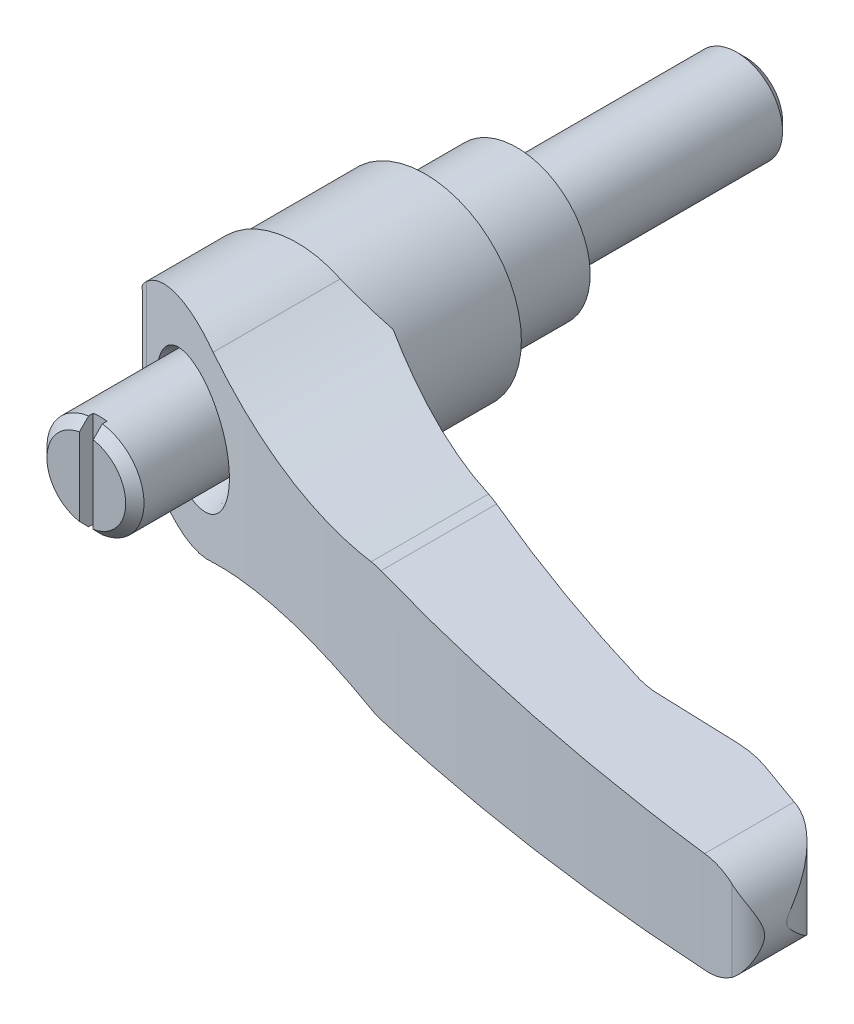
ISO-10303-21;
HEADER;
FILE_DESCRIPTION(('STEP AP214'),'2;1');
FILE_NAME('part.step','',(''),(''),'','','');
FILE_SCHEMA(('AUTOMOTIVE_DESIGN { 1 0 10303 214 1 1 1 1 }'));
ENDSEC;
DATA;
#1=APPLICATION_CONTEXT('core data for automotive mechanical design processes');
#2=APPLICATION_PROTOCOL_DEFINITION('international standard','automotive_design',2000,#1);
#3=PRODUCT_CONTEXT('',#1,'mechanical');
#4=PRODUCT('Part','Part','',(#3));
#5=PRODUCT_RELATED_PRODUCT_CATEGORY('part','',(#4));
#6=PRODUCT_DEFINITION_FORMATION('','',#4);
#7=PRODUCT_DEFINITION_CONTEXT('part definition',#1,'design');
#8=PRODUCT_DEFINITION('design','',#6,#7);
#9=PRODUCT_DEFINITION_SHAPE('','',#8);
#10=(LENGTH_UNIT() NAMED_UNIT(*) SI_UNIT(.MILLI.,.METRE.));
#11=(NAMED_UNIT(*) PLANE_ANGLE_UNIT() SI_UNIT($,.RADIAN.));
#12=(NAMED_UNIT(*) SI_UNIT($,.STERADIAN.) SOLID_ANGLE_UNIT());
#13=UNCERTAINTY_MEASURE_WITH_UNIT(LENGTH_MEASURE(1.E-05),#10,'distance_accuracy_value','');
#14=(GEOMETRIC_REPRESENTATION_CONTEXT(3) GLOBAL_UNCERTAINTY_ASSIGNED_CONTEXT((#13)) GLOBAL_UNIT_ASSIGNED_CONTEXT((#10,
#11,#12)) REPRESENTATION_CONTEXT('',''));
#15=CARTESIAN_POINT('',(0.,0.,0.));
#16=DIRECTION('',(0.,0.,1.));
#17=DIRECTION('',(1.,0.,0.));
#18=AXIS2_PLACEMENT_3D('',#15,#16,#17);
#19=CARTESIAN_POINT('',(-0.010000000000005,0.,27.8125));
#20=DIRECTION('',(0.,0.,-1.));
#21=DIRECTION('',(1.,0.,0.));
#22=AXIS2_PLACEMENT_3D('',#19,#20,#21);
#23=CYLINDRICAL_SURFACE('',#22,10.5);
#24=CARTESIAN_POINT('',(-0.0100000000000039,0.,24.));
#25=DIRECTION('',(0.,0.,1.));
#26=DIRECTION('',(0.,-1.,0.));
#27=AXIS2_PLACEMENT_3D('',#24,#25,#26);
#28=CIRCLE('',#27,10.5);
#29=CARTESIAN_POINT('',(-10.51,0.,24.));
#30=VERTEX_POINT('',#29);
#31=CARTESIAN_POINT('',(10.49,0.,24.));
#32=VERTEX_POINT('',#31);
#33=EDGE_CURVE('E571',#30,#32,#28,.T.);
#34=ORIENTED_EDGE('',*,*,#33,.F.);
#35=EDGE_CURVE('E575',#32,#30,#28,.T.);
#36=ORIENTED_EDGE('',*,*,#35,.F.);
#37=EDGE_LOOP('',(#34,#36));
#38=FACE_BOUND('',#37,.T.);
#39=CARTESIAN_POINT('',(-0.00999999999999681,0.,-0.250037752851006));
#40=DIRECTION('',(0.707106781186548,0.,0.707106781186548));
#41=DIRECTION('',(0.707106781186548,0.,-0.707106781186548));
#42=AXIS2_PLACEMENT_3D('',#39,#40,#41);
#43=ELLIPSE('',#42,14.8492424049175,10.5);
#44=CARTESIAN_POINT('',(-10.260037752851,-2.27743848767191,10.));
#45=VERTEX_POINT('',#44);
#46=CARTESIAN_POINT('',(-10.260037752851,2.27743848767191,10.));
#47=VERTEX_POINT('',#46);
#48=EDGE_CURVE('E294',#45,#47,#43,.F.);
#49=ORIENTED_EDGE('',*,*,#48,.F.);
#50=CARTESIAN_POINT('',(-0.0099999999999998,0.,10.));
#51=DIRECTION('',(0.,0.,-1.));
#52=DIRECTION('',(1.,0.,0.));
#53=AXIS2_PLACEMENT_3D('',#50,#51,#52);
#54=CIRCLE('',#53,10.5);
#55=EDGE_CURVE('E176',#47,#45,#54,.T.);
#56=ORIENTED_EDGE('',*,*,#55,.F.);
#57=EDGE_LOOP('',(#49,#56));
#58=FACE_BOUND('',#57,.T.);
#59=ADVANCED_FACE('F14',(#38,#58),#23,.T.);
#60=CARTESIAN_POINT('',(57.3760512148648,-12.,33.4699999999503));
#61=DIRECTION('',(0.,1.,0.));
#62=DIRECTION('',(-1.,0.,0.));
#63=AXIS2_PLACEMENT_3D('',#60,#61,#62);
#64=CYLINDRICAL_SURFACE('',#63,8.59000000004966);
#65=CARTESIAN_POINT('',(57.3760512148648,6.11892873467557,33.4699999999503));
#66=DIRECTION('',(0.0361204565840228,0.999347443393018,0.));
#67=DIRECTION('',(-0.999347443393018,0.0361204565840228,0.));
#68=AXIS2_PLACEMENT_3D('',#65,#66,#67);
#69=ELLIPSE('',#68,8.59560912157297,8.59000000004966);
#70=CARTESIAN_POINT('',(57.37605121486,6.11892873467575,42.06));
#71=VERTEX_POINT('',#70);
#72=CARTESIAN_POINT('',(55.1138126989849,6.20069518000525,41.7567591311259));
#73=VERTEX_POINT('',#72);
#74=EDGE_CURVE('E1126',#71,#73,#69,.F.);
#75=ORIENTED_EDGE('',*,*,#74,.F.);
#76=DIRECTION('',(0.,1.,0.));
#77=VECTOR('',#76,1.);
#78=CARTESIAN_POINT('',(57.37605121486,-12.,42.06));
#79=LINE('',#78,#77);
#80=CARTESIAN_POINT('',(57.37605121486,-6.11892873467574,42.06));
#81=VERTEX_POINT('',#80);
#82=EDGE_CURVE('E598',#81,#71,#79,.T.);
#83=ORIENTED_EDGE('',*,*,#82,.F.);
#84=CARTESIAN_POINT('',(57.3760512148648,-6.11892873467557,33.4699999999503));
#85=DIRECTION('',(0.0361204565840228,-0.999347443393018,0.));
#86=DIRECTION('',(0.999347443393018,0.0361204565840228,0.));
#87=AXIS2_PLACEMENT_3D('',#84,#85,#86);
#88=ELLIPSE('',#87,8.59560912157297,8.59000000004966);
#89=CARTESIAN_POINT('',(55.1138126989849,-6.20069518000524,41.7567591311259));
#90=VERTEX_POINT('',#89);
#91=EDGE_CURVE('E1119',#90,#81,#88,.F.);
#92=ORIENTED_EDGE('',*,*,#91,.F.);
#93=DIRECTION('',(0.,1.,0.));
#94=VECTOR('',#93,1.);
#95=CARTESIAN_POINT('',(55.1138126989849,-12.,41.7567591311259));
#96=LINE('',#95,#94);
#97=EDGE_CURVE('E601',#90,#73,#96,.T.);
#98=ORIENTED_EDGE('',*,*,#97,.T.);
#99=EDGE_LOOP('',(#75,#83,#92,#98));
#100=FACE_BOUND('',#99,.T.);
#101=ADVANCED_FACE('F384',(#100),#64,.F.);
#102=CARTESIAN_POINT('',(57.37605121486,-12.,42.06));
#103=DIRECTION('',(0.,0.,1.));
#104=DIRECTION('',(0.,-1.,0.));
#105=AXIS2_PLACEMENT_3D('',#102,#103,#104);
#106=PLANE('',#105);
#107=DIRECTION('',(-0.999347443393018,0.0361204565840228,0.));
#108=VECTOR('',#107,1.);
#109=CARTESIAN_POINT('',(58.0300881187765,6.09528919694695,42.06));
#110=LINE('',#109,#108);
#111=CARTESIAN_POINT('',(66.163324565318,5.80132115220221,42.06));
#112=VERTEX_POINT('',#111);
#113=EDGE_CURVE('E1127',#112,#71,#110,.T.);
#114=ORIENTED_EDGE('',*,*,#113,.F.);
#115=DIRECTION('',(0.,1.,0.));
#116=VECTOR('',#115,1.);
#117=CARTESIAN_POINT('',(66.163324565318,-12.,42.06));
#118=LINE('',#117,#116);
#119=CARTESIAN_POINT('',(66.163324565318,-5.80132115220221,42.06));
#120=VERTEX_POINT('',#119);
#121=EDGE_CURVE('E595',#120,#112,#118,.T.);
#122=ORIENTED_EDGE('',*,*,#121,.F.);
#123=DIRECTION('',(0.999347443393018,0.0361204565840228,0.));
#124=VECTOR('',#123,1.);
#125=CARTESIAN_POINT('',(57.1637628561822,-6.12660169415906,42.06));
#126=LINE('',#125,#124);
#127=EDGE_CURVE('E1124',#81,#120,#126,.T.);
#128=ORIENTED_EDGE('',*,*,#127,.F.);
#129=ORIENTED_EDGE('',*,*,#82,.T.);
#130=EDGE_LOOP('',(#114,#122,#128,#129));
#131=FACE_BOUND('',#130,.T.);
#132=ADVANCED_FACE('F523',(#131),#106,.F.);
#133=CARTESIAN_POINT('',(66.1633245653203,-12.,53.3399999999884));
#134=DIRECTION('',(0.,1.,0.));
#135=DIRECTION('',(-1.,0.,0.));
#136=AXIS2_PLACEMENT_3D('',#133,#134,#135);
#137=CYLINDRICAL_SURFACE('',#136,11.2799999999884);
#138=CARTESIAN_POINT('',(66.1633245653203,5.80132115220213,53.3399999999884));
#139=DIRECTION('',(0.0361204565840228,0.999347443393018,0.));
#140=DIRECTION('',(-0.999347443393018,0.0361204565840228,0.));
#141=AXIS2_PLACEMENT_3D('',#138,#139,#140);
#142=ELLIPSE('',#141,11.2873656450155,11.2799999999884);
#143=CARTESIAN_POINT('',(69.761185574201,5.6712799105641,42.649172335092));
#144=VERTEX_POINT('',#143);
#145=EDGE_CURVE('E1128',#144,#112,#142,.T.);
#146=ORIENTED_EDGE('',*,*,#145,.F.);
#147=DIRECTION('',(0.,1.,0.));
#148=VECTOR('',#147,1.);
#149=CARTESIAN_POINT('',(69.761185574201,-12.,42.649172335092));
#150=LINE('',#149,#148);
#151=CARTESIAN_POINT('',(69.761185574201,-5.6712799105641,42.649172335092));
#152=VERTEX_POINT('',#151);
#153=EDGE_CURVE('E592',#152,#144,#150,.T.);
#154=ORIENTED_EDGE('',*,*,#153,.F.);
#155=CARTESIAN_POINT('',(66.1633245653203,-5.80132115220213,53.3399999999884));
#156=DIRECTION('',(0.0361204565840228,-0.999347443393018,0.));
#157=DIRECTION('',(0.999347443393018,0.0361204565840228,0.));
#158=AXIS2_PLACEMENT_3D('',#155,#156,#157);
#159=ELLIPSE('',#158,11.2873656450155,11.2799999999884);
#160=EDGE_CURVE('E1149',#120,#152,#159,.T.);
#161=ORIENTED_EDGE('',*,*,#160,.F.);
#162=ORIENTED_EDGE('',*,*,#121,.T.);
#163=EDGE_LOOP('',(#146,#154,#161,#162));
#164=FACE_BOUND('',#163,.T.);
#165=ADVANCED_FACE('F424',(#164),#137,.T.);
#166=CARTESIAN_POINT('',(111.590768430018,-12.,-165.122809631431));
#167=DIRECTION('',(0.,1.,0.));
#168=DIRECTION('',(-1.,0.,0.));
#169=AXIS2_PLACEMENT_3D('',#166,#167,#168);
#170=CYLINDRICAL_SURFACE('',#169,214.450000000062);
#171=CARTESIAN_POINT('',(30.179428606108,-6.9666323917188,33.2732494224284));
#172=CARTESIAN_POINT('',(30.4222007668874,-7.0028281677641,33.3728739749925));
#173=CARTESIAN_POINT('',(30.6665043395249,-7.02781937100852,33.472598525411));
#174=CARTESIAN_POINT('',(31.033921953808,-7.04840105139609,33.6217860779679));
#175=CARTESIAN_POINT('',(31.1565128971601,-7.05244559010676,33.6714318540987));
#176=CARTESIAN_POINT('',(31.4020580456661,-7.05489552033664,33.7706062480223));
#177=CARTESIAN_POINT('',(31.5250125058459,-7.05329063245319,33.820134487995));
#178=CARTESIAN_POINT('',(31.647932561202,-7.0488469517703,33.8695155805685));
#179=B_SPLINE_CURVE_WITH_KNOTS('',3,(#171,#172,#173,#174,#175,#176,#177,#178),.UNSPECIFIED.,.F.,
.F.,(4,2,2,4),(0.,0.794258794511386,1.19111760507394,1.58869889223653),.UNSPECIFIED.);
#180=CARTESIAN_POINT('',(30.179428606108,-6.9666323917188,33.2732494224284));
#181=VERTEX_POINT('',#180);
#182=CARTESIAN_POINT('',(31.647932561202,-7.0488469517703,33.8695155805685));
#183=VERTEX_POINT('',#182);
#184=EDGE_CURVE('E440',#181,#183,#179,.T.);
#185=ORIENTED_EDGE('',*,*,#184,.F.);
#186=CARTESIAN_POINT('',(10.49,-8.03465812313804,24.));
#187=CARTESIAN_POINT('',(11.2781269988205,-7.82806345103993,24.4213315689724));
#188=CARTESIAN_POINT('',(12.0728488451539,-7.64070973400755,24.8398212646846));
#189=CARTESIAN_POINT('',(13.6740672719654,-7.30530099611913,25.6700985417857));
#190=CARTESIAN_POINT('',(14.4805646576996,-7.15724867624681,26.0818856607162));
#191=CARTESIAN_POINT('',(16.0966341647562,-6.90241973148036,26.8940746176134));
#192=CARTESIAN_POINT('',(16.906116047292,-6.79528972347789,27.2945449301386));
#193=CARTESIAN_POINT('',(18.5335723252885,-6.62127786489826,28.0868684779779));
#194=CARTESIAN_POINT('',(19.3515465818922,-6.55439535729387,28.4787218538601));
#195=CARTESIAN_POINT('',(20.9944633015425,-6.46166065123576,29.2529521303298));
#196=CARTESIAN_POINT('',(21.8194069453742,-6.43581555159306,29.6353273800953));
#197=CARTESIAN_POINT('',(23.474294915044,-6.42593469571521,30.3896366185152));
#198=CARTESIAN_POINT('',(24.3042391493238,-6.44189817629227,30.7615707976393));
#199=CARTESIAN_POINT('',(25.974600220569,-6.51667337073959,31.497417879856));
#200=CARTESIAN_POINT('',(26.8150445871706,-6.57586454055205,31.8612301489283));
#201=CARTESIAN_POINT('',(28.4970001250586,-6.7381558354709,32.5766232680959));
#202=CARTESIAN_POINT('',(29.3385114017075,-6.84126069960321,32.9282027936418));
#203=CARTESIAN_POINT('',(30.179428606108,-6.96663239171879,33.2732494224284));
#204=B_SPLINE_CURVE_WITH_KNOTS('',3,(#186,#187,#188,#189,#190,#191,#192,#193,#194,#195,#196,
#197,#198,#199,#200,#201,#202,#203),.UNSPECIFIED.,.F.,.F.,(4,2,2,2,2,2,2,2,4),(0.,
2.7515590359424,5.50330712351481,8.23072437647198,10.9580971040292,13.6859415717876,
16.4137362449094,19.1657679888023,21.9180967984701),.UNSPECIFIED.);
#205=CARTESIAN_POINT('',(10.49,-8.03465812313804,24.));
#206=VERTEX_POINT('',#205);
#207=EDGE_CURVE('E431',#206,#181,#204,.T.);
#208=ORIENTED_EDGE('',*,*,#207,.F.);
#209=DIRECTION('',(0.,1.,0.));
#210=VECTOR('',#209,1.);
#211=CARTESIAN_POINT('',(10.49,-12.,24.));
#212=LINE('',#211,#210);
#213=EDGE_CURVE('E605',#206,#32,#212,.T.);
#214=ORIENTED_EDGE('',*,*,#213,.T.);
#215=CARTESIAN_POINT('',(10.49,8.03465812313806,24.));
#216=VERTEX_POINT('',#215);
#217=EDGE_CURVE('E604',#32,#216,#212,.T.);
#218=ORIENTED_EDGE('',*,*,#217,.T.);
#219=CARTESIAN_POINT('',(30.179428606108,6.9666323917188,33.2732494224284));
#220=CARTESIAN_POINT('',(29.3385114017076,6.84126069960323,32.9282027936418));
#221=CARTESIAN_POINT('',(28.4970001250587,6.73815583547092,32.5766232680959));
#222=CARTESIAN_POINT('',(26.8150445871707,6.57586454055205,31.8612301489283));
#223=CARTESIAN_POINT('',(25.974600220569,6.51667337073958,31.497417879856));
#224=CARTESIAN_POINT('',(24.3042391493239,6.44189817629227,30.7615707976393));
#225=CARTESIAN_POINT('',(23.4742949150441,6.42593469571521,30.3896366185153));
#226=CARTESIAN_POINT('',(21.8194069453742,6.43581555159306,29.6353273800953));
#227=CARTESIAN_POINT('',(20.9944633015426,6.46166065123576,29.2529521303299));
#228=CARTESIAN_POINT('',(19.3515465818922,6.55439535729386,28.4787218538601));
#229=CARTESIAN_POINT('',(18.5335723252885,6.62127786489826,28.0868684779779));
#230=CARTESIAN_POINT('',(16.906116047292,6.79528972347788,27.2945449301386));
#231=CARTESIAN_POINT('',(16.0966341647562,6.90241973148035,26.8940746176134));
#232=CARTESIAN_POINT('',(14.4805646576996,7.15724867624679,26.0818856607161));
#233=CARTESIAN_POINT('',(13.6740672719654,7.30530099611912,25.6700985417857));
#234=CARTESIAN_POINT('',(12.0728488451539,7.64070973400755,24.8398212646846));
#235=CARTESIAN_POINT('',(11.2781269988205,7.82806345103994,24.4213315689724));
#236=CARTESIAN_POINT('',(10.49,8.03465812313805,24.));
#237=B_SPLINE_CURVE_WITH_KNOTS('',3,(#219,#220,#221,#222,#223,#224,#225,#226,#227,#228,#229,
#230,#231,#232,#233,#234,#235,#236),.UNSPECIFIED.,.F.,.F.,(4,2,2,2,2,2,2,2,4),(0.,
2.75232880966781,5.50436055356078,8.23215522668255,10.9599996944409,13.6873724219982,
16.4147896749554,19.1665377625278,21.9180967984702),.UNSPECIFIED.);
#238=CARTESIAN_POINT('',(30.179428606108,6.9666323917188,33.2732494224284));
#239=VERTEX_POINT('',#238);
#240=EDGE_CURVE('E411',#239,#216,#237,.T.);
#241=ORIENTED_EDGE('',*,*,#240,.F.);
#242=CARTESIAN_POINT('',(31.647932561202,7.0488469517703,33.8695155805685));
#243=CARTESIAN_POINT('',(31.5250125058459,7.05329063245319,33.820134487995));
#244=CARTESIAN_POINT('',(31.4020580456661,7.05489552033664,33.7706062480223));
#245=CARTESIAN_POINT('',(31.1565128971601,7.05244559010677,33.6714318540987));
#246=CARTESIAN_POINT('',(31.033921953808,7.04840105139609,33.6217860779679));
#247=CARTESIAN_POINT('',(30.666504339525,7.02781937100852,33.472598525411));
#248=CARTESIAN_POINT('',(30.4222007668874,7.0028281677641,33.3728739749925));
#249=CARTESIAN_POINT('',(30.179428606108,6.9666323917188,33.2732494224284));
#250=B_SPLINE_CURVE_WITH_KNOTS('',3,(#242,#243,#244,#245,#246,#247,#248,#249),.UNSPECIFIED.,.F.,
.F.,(4,2,2,4),(0.,0.39758128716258,0.794440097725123,1.58869889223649),.UNSPECIFIED.);
#251=CARTESIAN_POINT('',(31.647932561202,7.0488469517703,33.8695155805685));
#252=VERTEX_POINT('',#251);
#253=EDGE_CURVE('E403',#252,#239,#250,.T.);
#254=ORIENTED_EDGE('',*,*,#253,.F.);
#255=CARTESIAN_POINT('',(111.590768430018,4.15938968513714,-165.122809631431));
#256=DIRECTION('',(0.0361204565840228,0.999347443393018,0.));
#257=DIRECTION('',(-0.999347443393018,0.0361204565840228,0.));
#258=AXIS2_PLACEMENT_3D('',#255,#256,#257);
#259=ELLIPSE('',#258,214.590032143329,214.450000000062);
#260=EDGE_CURVE('E412',#73,#252,#259,.F.);
#261=ORIENTED_EDGE('',*,*,#260,.F.);
#262=ORIENTED_EDGE('',*,*,#97,.F.);
#263=CARTESIAN_POINT('',(111.590768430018,-4.15938968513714,-165.122809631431));
#264=DIRECTION('',(0.0361204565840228,-0.999347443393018,0.));
#265=DIRECTION('',(0.999347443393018,0.0361204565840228,0.));
#266=AXIS2_PLACEMENT_3D('',#263,#264,#265);
#267=ELLIPSE('',#266,214.590032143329,214.450000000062);
#268=EDGE_CURVE('E1117',#183,#90,#267,.F.);
#269=ORIENTED_EDGE('',*,*,#268,.F.);
#270=EDGE_LOOP('',(#185,#208,#214,#218,#241,#254,#261,#262,#269));
#271=FACE_BOUND('',#270,.T.);
#272=ADVANCED_FACE('F419',(#271),#170,.F.);
#273=CARTESIAN_POINT('',(79.996705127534,-12.,50.539592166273));
#274=DIRECTION('',(-0.99233193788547,0.,0.123601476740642));
#275=DIRECTION('',(-0.123601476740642,0.,-0.99233193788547));
#276=AXIS2_PLACEMENT_3D('',#273,#274,#275);
#277=PLANE('',#276);
#278=CARTESIAN_POINT('',(74.5,0.,6.40940703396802));
#279=DIRECTION('',(-0.99233193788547,0.,0.123601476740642));
#280=DIRECTION('',(0.123601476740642,0.,0.99233193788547));
#281=AXIS2_PLACEMENT_3D('',#278,#279,#280);
#282=ELLIPSE('',#281,44.4978502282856,5.5);
#283=CARTESIAN_POINT('',(79.996705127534,-0.190348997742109,50.539592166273));
#284=VERTEX_POINT('',#283);
#285=CARTESIAN_POINT('',(79.996705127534,0.190348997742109,50.539592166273));
#286=VERTEX_POINT('',#285);
#287=EDGE_CURVE('E505',#284,#286,#282,.T.);
#288=ORIENTED_EDGE('',*,*,#287,.F.);
#289=DIRECTION('',(0.,1.,0.));
#290=VECTOR('',#289,1.);
#291=CARTESIAN_POINT('',(79.996705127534,-12.,50.539592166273));
#292=LINE('',#291,#290);
#293=EDGE_CURVE('E586',#284,#286,#292,.T.);
#294=ORIENTED_EDGE('',*,*,#293,.T.);
#295=EDGE_LOOP('',(#288,#294));
#296=FACE_BOUND('',#295,.T.);
#297=ADVANCED_FACE('F423',(#296),#277,.F.);
#298=CARTESIAN_POINT('',(72.6137555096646,-12.,51.4591871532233));
#299=DIRECTION('',(0.,1.,0.));
#300=DIRECTION('',(-1.,0.,0.));
#301=AXIS2_PLACEMENT_3D('',#298,#299,#300);
#302=CYLINDRICAL_SURFACE('',#301,7.44000000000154);
#303=CARTESIAN_POINT('',(74.986812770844,-5.47841339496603,44.407790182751));
#304=CARTESIAN_POINT('',(75.1398120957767,-5.4648402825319,44.4592429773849));
#305=CARTESIAN_POINT('',(75.2905169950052,-5.44496899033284,44.5155387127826));
#306=CARTESIAN_POINT('',(75.5860882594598,-5.39377415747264,44.6368581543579));
#307=CARTESIAN_POINT('',(75.730963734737,-5.36246932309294,44.7018674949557));
#308=CARTESIAN_POINT('',(76.0125967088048,-5.2898955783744,44.839081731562));
#309=CARTESIAN_POINT('',(76.149425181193,-5.248738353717,44.9112009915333));
#310=CARTESIAN_POINT('',(76.4161065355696,-5.1573648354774,45.062373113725));
#311=CARTESIAN_POINT('',(76.5459558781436,-5.10714400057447,45.1414294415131));
#312=CARTESIAN_POINT('',(76.827653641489,-4.98604991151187,45.3247681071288));
#313=CARTESIAN_POINT('',(76.9775772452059,-4.91309116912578,45.4306358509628));
#314=CARTESIAN_POINT('',(77.2657899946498,-4.75681575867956,45.6501400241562));
#315=CARTESIAN_POINT('',(77.4040776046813,-4.67349772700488,45.7637774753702));
#316=CARTESIAN_POINT('',(77.8028296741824,-4.40945601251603,46.1156758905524));
#317=CARTESIAN_POINT('',(78.0457801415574,-4.21527563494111,46.3639882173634));
#318=CARTESIAN_POINT('',(78.4176945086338,-3.86589184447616,46.7984433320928));
#319=CARTESIAN_POINT('',(78.558647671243,-3.71726415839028,46.9799982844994));
#320=CARTESIAN_POINT('',(78.8199419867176,-3.41009407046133,47.3496806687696));
#321=CARTESIAN_POINT('',(78.9402736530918,-3.25154715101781,47.5378110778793));
#322=CARTESIAN_POINT('',(79.1607378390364,-2.92676895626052,47.9181651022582));
#323=CARTESIAN_POINT('',(79.2609186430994,-2.76055725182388,48.1103776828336));
#324=CARTESIAN_POINT('',(79.4421677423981,-2.42115236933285,48.497428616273));
#325=CARTESIAN_POINT('',(79.5232445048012,-2.24796232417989,48.6922657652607));
#326=CARTESIAN_POINT('',(79.657896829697,-1.91676087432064,49.0578102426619));
#327=CARTESIAN_POINT('',(79.713648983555,-1.75958096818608,49.2284695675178));
#328=CARTESIAN_POINT('',(79.7869638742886,-1.51825146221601,49.4826945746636));
#329=CARTESIAN_POINT('',(79.8097141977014,-1.43673320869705,49.5672896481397));
#330=CARTESIAN_POINT('',(79.8517302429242,-1.27132927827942,49.7350141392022));
#331=CARTESIAN_POINT('',(79.8709966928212,-1.18744410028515,49.8181438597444));
#332=CARTESIAN_POINT('',(79.907186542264,-1.01046435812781,49.986973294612));
#333=CARTESIAN_POINT('',(79.9238666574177,-0.917129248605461,50.0724723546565));
#334=CARTESIAN_POINT('',(79.9529450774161,-0.724505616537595,50.2358460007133));
#335=CARTESIAN_POINT('',(79.9653823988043,-0.625281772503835,50.3137850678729));
#336=CARTESIAN_POINT('',(79.9802376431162,-0.46858024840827,50.4153149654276));
#337=CARTESIAN_POINT('',(79.9845030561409,-0.416215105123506,50.4460963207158));
#338=CARTESIAN_POINT('',(79.9917045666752,-0.306879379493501,50.4998809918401));
#339=CARTESIAN_POINT('',(79.9946243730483,-0.249861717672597,50.522788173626));
#340=CARTESIAN_POINT('',(79.996705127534,-0.190348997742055,50.539592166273));
#341=B_SPLINE_CURVE_WITH_KNOTS('',3,(#303,#304,#305,#306,#307,#308,#309,#310,#311,#312,#313,
#314,#315,#316,#317,#318,#319,#320,#321,#322,#323,#324,#325,#326,#327,#328,#329,#330,#331,#332,
#333,#334,#335,#336,#337,#338,#339,#340),.UNSPECIFIED.,.F.,.F.,(4,2,2,2,2,2,2,2,2,2,2,2,2,2,2,2,
2,2,4),(0.,0.485611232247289,0.970431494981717,1.44999646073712,1.92980238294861,
2.52141817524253,3.11311192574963,4.30183389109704,5.12208341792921,5.94270927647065,
6.76134473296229,7.57961667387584,8.29494630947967,8.65387747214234,9.01273353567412,
9.39561932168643,9.77488268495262,9.95698827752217,10.1412441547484),.UNSPECIFIED.);
#342=CARTESIAN_POINT('',(74.986812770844,-5.47841339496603,44.407790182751));
#343=VERTEX_POINT('',#342);
#344=EDGE_CURVE('E504',#343,#284,#341,.T.);
#345=ORIENTED_EDGE('',*,*,#344,.F.);
#346=DIRECTION('',(0.,1.,0.));
#347=VECTOR('',#346,1.);
#348=CARTESIAN_POINT('',(74.986812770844,-12.,44.407790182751));
#349=LINE('',#348,#347);
#350=CARTESIAN_POINT('',(74.986812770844,5.47841339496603,44.407790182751));
#351=VERTEX_POINT('',#350);
#352=EDGE_CURVE('E589',#343,#351,#349,.T.);
#353=ORIENTED_EDGE('',*,*,#352,.T.);
#354=CARTESIAN_POINT('',(79.996705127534,0.190348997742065,50.539592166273));
#355=CARTESIAN_POINT('',(79.9951469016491,0.235214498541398,50.5270575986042));
#356=CARTESIAN_POINT('',(79.9930953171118,0.278736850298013,50.5108629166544));
#357=CARTESIAN_POINT('',(79.9881648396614,0.363077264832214,50.47327081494));
#358=CARTESIAN_POINT('',(79.9852922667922,0.403913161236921,50.451913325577));
#359=CARTESIAN_POINT('',(79.9757020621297,0.522458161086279,50.3833482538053));
#360=CARTESIAN_POINT('',(79.9679715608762,0.597169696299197,50.3312876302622));
#361=CARTESIAN_POINT('',(79.950886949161,0.736456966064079,50.225155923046));
#362=CARTESIAN_POINT('',(79.9416856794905,0.801375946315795,50.1714851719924));
#363=CARTESIAN_POINT('',(79.9214540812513,0.928420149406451,50.0612288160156));
#364=CARTESIAN_POINT('',(79.9104232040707,0.990544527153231,50.0046423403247));
#365=CARTESIAN_POINT('',(79.8746515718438,1.17419942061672,49.832312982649));
#366=CARTESIAN_POINT('',(79.847248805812,1.29287988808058,49.7141099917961));
#367=CARTESIAN_POINT('',(79.7848398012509,1.52823594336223,49.4729704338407));
#368=CARTESIAN_POINT('',(79.749692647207,1.64482416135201,49.3499864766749));
#369=CARTESIAN_POINT('',(79.6721004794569,1.8745831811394,49.1033284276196));
#370=CARTESIAN_POINT('',(79.6296610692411,1.98775652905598,48.9796549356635));
#371=CARTESIAN_POINT('',(79.5033816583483,2.29352791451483,48.641550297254));
#372=CARTESIAN_POINT('',(79.4120558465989,2.48329449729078,48.4272966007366));
#373=CARTESIAN_POINT('',(79.2061355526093,2.85434488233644,48.0023120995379));
#374=CARTESIAN_POINT('',(79.0915236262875,3.03562219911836,47.791584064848));
#375=CARTESIAN_POINT('',(78.8390032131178,3.38665877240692,47.3777391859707));
#376=CARTESIAN_POINT('',(78.7012752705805,3.5564939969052,47.174577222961));
#377=CARTESIAN_POINT('',(78.4009143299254,3.88356808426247,46.7768350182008));
#378=CARTESIAN_POINT('',(78.2383021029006,4.04081728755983,46.5822477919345));
#379=CARTESIAN_POINT('',(77.9568022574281,4.28016983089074,46.2794503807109));
#380=CARTESIAN_POINT('',(77.8461272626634,4.36735584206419,46.1675710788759));
#381=CARTESIAN_POINT('',(77.615129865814,4.53501217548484,45.9487274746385));
#382=CARTESIAN_POINT('',(77.4948054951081,4.61548112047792,45.8417641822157));
#383=CARTESIAN_POINT('',(77.2447591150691,4.76840923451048,45.633916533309));
#384=CARTESIAN_POINT('',(77.1150589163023,4.84088606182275,45.5330190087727));
#385=CARTESIAN_POINT('',(76.846172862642,4.97676025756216,45.3380932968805));
#386=CARTESIAN_POINT('',(76.7069926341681,5.04016294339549,45.2440611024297));
#387=CARTESIAN_POINT('',(76.4438690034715,5.14664435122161,45.079244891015));
#388=CARTESIAN_POINT('',(76.3213555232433,5.19134589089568,45.0072256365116));
#389=CARTESIAN_POINT('',(76.0703754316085,5.27269544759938,44.8693561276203));
#390=CARTESIAN_POINT('',(75.9419112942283,5.30934677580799,44.803503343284));
#391=CARTESIAN_POINT('',(75.6784961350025,5.3739797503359,44.6781572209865));
#392=CARTESIAN_POINT('',(75.5435027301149,5.40189236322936,44.618716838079));
#393=CARTESIAN_POINT('',(75.268600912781,5.44782102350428,44.5073869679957));
#394=CARTESIAN_POINT('',(75.1286862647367,5.46582399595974,44.4555075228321));
#395=CARTESIAN_POINT('',(74.986812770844,5.47841339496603,44.407790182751));
#396=B_SPLINE_CURVE_WITH_KNOTS('',3,(#354,#355,#356,#357,#358,#359,#360,#361,#362,#363,#364,
#365,#366,#367,#368,#369,#370,#371,#372,#373,#374,#375,#376,#377,#378,#379,#380,#381,#382,#383,
#384,#385,#386,#387,#388,#389,#390,#391,#392,#393,#394,#395),.UNSPECIFIED.,.F.,.F.,(4,2,2,2,2,2,
2,2,2,2,2,2,2,2,2,2,2,2,2,2,4),(0.,0.139245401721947,0.277446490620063,0.550810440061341,
0.804906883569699,1.05907965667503,1.56794086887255,2.08696422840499,2.60559053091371,
3.50582150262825,4.4067293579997,5.30090298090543,6.19433426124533,6.73367946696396,
7.27313498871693,7.81137365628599,8.34929561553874,8.7958064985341,9.24213337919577,
9.69190199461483,10.1422626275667),.UNSPECIFIED.);
#397=EDGE_CURVE('E498',#286,#351,#396,.T.);
#398=ORIENTED_EDGE('',*,*,#397,.F.);
#399=ORIENTED_EDGE('',*,*,#293,.F.);
#400=EDGE_LOOP('',(#345,#353,#398,#399));
#401=FACE_BOUND('',#400,.T.);
#402=ADVANCED_FACE('F511',(#401),#302,.T.);
#403=CARTESIAN_POINT('',(69.761185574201,-12.,42.649172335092));
#404=DIRECTION('',(-0.318959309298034,0.,0.947768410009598));
#405=DIRECTION('',(-0.947768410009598,0.,-0.318959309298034));
#406=AXIS2_PLACEMENT_3D('',#403,#404,#405);
#407=PLANE('',#406);
#408=DIRECTION('',(-0.947212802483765,0.0342360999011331,-0.318772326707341));
#409=VECTOR('',#408,1.);
#410=CARTESIAN_POINT('',(70.3342452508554,5.65056721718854,42.8420282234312));
#411=LINE('',#410,#409);
#412=CARTESIAN_POINT('',(74.5,5.5,44.2439595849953));
#413=VERTEX_POINT('',#412);
#414=EDGE_CURVE('E1132',#413,#144,#411,.T.);
#415=ORIENTED_EDGE('',*,*,#414,.F.);
#416=CARTESIAN_POINT('',(74.5,0.,44.2439595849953));
#417=DIRECTION('',(-0.318959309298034,0.,0.947768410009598));
#418=DIRECTION('',(0.947768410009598,0.,0.318959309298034));
#419=AXIS2_PLACEMENT_3D('',#416,#417,#418);
#420=ELLIPSE('',#419,5.80310542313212,5.5);
#421=EDGE_CURVE('E1133',#351,#413,#420,.T.);
#422=ORIENTED_EDGE('',*,*,#421,.F.);
#423=ORIENTED_EDGE('',*,*,#352,.F.);
#424=CARTESIAN_POINT('',(74.5,-5.5,44.2439595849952));
#425=VERTEX_POINT('',#424);
#426=EDGE_CURVE('E1134',#425,#343,#420,.T.);
#427=ORIENTED_EDGE('',*,*,#426,.F.);
#428=DIRECTION('',(0.947212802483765,0.0342360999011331,0.318772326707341));
#429=VECTOR('',#428,1.);
#430=CARTESIAN_POINT('',(69.5559523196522,-5.6786978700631,42.5801037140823));
#431=LINE('',#430,#429);
#432=EDGE_CURVE('E446',#152,#425,#431,.T.);
#433=ORIENTED_EDGE('',*,*,#432,.F.);
#434=ORIENTED_EDGE('',*,*,#153,.T.);
#435=EDGE_LOOP('',(#415,#422,#423,#427,#433,#434));
#436=FACE_BOUND('',#435,.T.);
#437=ADVANCED_FACE('F516',(#436),#407,.F.);
#438=CARTESIAN_POINT('',(-10.51,-12.,24.));
#439=DIRECTION('',(0.,0.,1.));
#440=DIRECTION('',(0.,-1.,0.));
#441=AXIS2_PLACEMENT_3D('',#438,#439,#440);
#442=PLANE('',#441);
#443=CARTESIAN_POINT('',(22.94,55.5300000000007,24.));
#444=DIRECTION('',(0.,0.,1.));
#445=DIRECTION('',(0.,-1.,0.));
#446=AXIS2_PLACEMENT_3D('',#443,#444,#445);
#447=CIRCLE('',#446,49.1000000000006);
#448=CARTESIAN_POINT('',(4.7225102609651,9.9346815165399,24.));
#449=VERTEX_POINT('',#448);
#450=EDGE_CURVE('E572',#216,#449,#447,.F.);
#451=ORIENTED_EDGE('',*,*,#450,.F.);
#452=ORIENTED_EDGE('',*,*,#217,.F.);
#453=ORIENTED_EDGE('',*,*,#35,.T.);
#454=DIRECTION('',(0.,1.,0.));
#455=VECTOR('',#454,1.);
#456=CARTESIAN_POINT('',(-10.51,-12.,24.));
#457=LINE('',#456,#455);
#458=CARTESIAN_POINT('',(-10.51,3.24652121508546,24.));
#459=VERTEX_POINT('',#458);
#460=EDGE_CURVE('E606',#30,#459,#457,.T.);
#461=ORIENTED_EDGE('',*,*,#460,.T.);
#462=CARTESIAN_POINT('',(0.,0.,24.));
#463=DIRECTION('',(0.,0.,1.));
#464=DIRECTION('',(0.,-1.,0.));
#465=AXIS2_PLACEMENT_3D('',#462,#463,#464);
#466=CIRCLE('',#465,11.);
#467=EDGE_CURVE('E618',#449,#459,#466,.T.);
#468=ORIENTED_EDGE('',*,*,#467,.F.);
#469=EDGE_LOOP('',(#451,#452,#453,#461,#468));
#470=FACE_BOUND('',#469,.T.);
#471=ADVANCED_FACE('F427',(#470),#442,.F.);
#472=CARTESIAN_POINT('',(22.94,-55.5300000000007,24.));
#473=DIRECTION('',(0.,0.,1.));
#474=DIRECTION('',(0.,-1.,0.));
#475=AXIS2_PLACEMENT_3D('',#472,#473,#474);
#476=CIRCLE('',#475,49.1000000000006);
#477=CARTESIAN_POINT('',(4.7225102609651,-9.9346815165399,24.));
#478=VERTEX_POINT('',#477);
#479=EDGE_CURVE('E447',#478,#206,#476,.F.);
#480=ORIENTED_EDGE('',*,*,#479,.F.);
#481=CARTESIAN_POINT('',(0.,0.,24.));
#482=DIRECTION('',(0.,0.,1.));
#483=DIRECTION('',(0.,-1.,0.));
#484=AXIS2_PLACEMENT_3D('',#481,#482,#483);
#485=CIRCLE('',#484,11.);
#486=CARTESIAN_POINT('',(-10.51,-3.24652121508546,24.));
#487=VERTEX_POINT('',#486);
#488=EDGE_CURVE('E632',#487,#478,#485,.T.);
#489=ORIENTED_EDGE('',*,*,#488,.F.);
#490=EDGE_CURVE('E607',#487,#30,#457,.T.);
#491=ORIENTED_EDGE('',*,*,#490,.T.);
#492=ORIENTED_EDGE('',*,*,#33,.T.);
#493=ORIENTED_EDGE('',*,*,#213,.F.);
#494=EDGE_LOOP('',(#480,#489,#491,#492,#493));
#495=FACE_BOUND('',#494,.T.);
#496=ADVANCED_FACE('F642',(#495),#442,.F.);
#497=CARTESIAN_POINT('',(77.9746679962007,-12.,52.1048483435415));
#498=DIRECTION('',(0.,1.,0.));
#499=DIRECTION('',(-1.,0.,0.));
#500=AXIS2_PLACEMENT_3D('',#497,#498,#499);
#501=CYLINDRICAL_SURFACE('',#500,2.20000000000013);
#502=CARTESIAN_POINT('',(77.798742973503,4.40094248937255,54.297803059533));
#503=CARTESIAN_POINT('',(77.873929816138,4.34461033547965,54.3038288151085));
#504=CARTESIAN_POINT('',(77.9477917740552,4.28621521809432,54.3058709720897));
#505=CARTESIAN_POINT('',(78.0922208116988,4.16589830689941,54.3028912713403));
#506=CARTESIAN_POINT('',(78.1627937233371,4.10398322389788,54.2978824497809));
#507=CARTESIAN_POINT('',(78.2996338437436,3.97761161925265,54.2817956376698));
#508=CARTESIAN_POINT('',(78.3659353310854,3.91318450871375,54.2707752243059));
#509=CARTESIAN_POINT('',(78.4947211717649,3.78162408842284,54.2435114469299));
#510=CARTESIAN_POINT('',(78.5572032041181,3.71448917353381,54.2272649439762));
#511=CARTESIAN_POINT('',(78.7037263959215,3.54901721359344,54.182483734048));
#512=CARTESIAN_POINT('',(78.7857223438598,3.44948168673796,54.1516573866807));
#513=CARTESIAN_POINT('',(78.9414411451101,3.24653335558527,54.0828783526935));
#514=CARTESIAN_POINT('',(79.0151615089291,3.14311939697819,54.0449235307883));
#515=CARTESIAN_POINT('',(79.2246832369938,2.82692774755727,53.9224540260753));
#516=CARTESIAN_POINT('',(79.3481089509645,2.609042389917,53.829588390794));
#517=CARTESIAN_POINT('',(79.5118173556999,2.26904106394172,53.6805956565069));
#518=CARTESIAN_POINT('',(79.5637254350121,2.15065893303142,53.6280001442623));
#519=CARTESIAN_POINT('',(79.6590195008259,1.91080459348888,53.5218995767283));
#520=CARTESIAN_POINT('',(79.7024022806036,1.789331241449,53.4683941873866));
#521=CARTESIAN_POINT('',(79.7806945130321,1.54303752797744,53.3628544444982));
#522=CARTESIAN_POINT('',(79.8156035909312,1.41821701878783,53.3108201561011));
#523=CARTESIAN_POINT('',(79.8768533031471,1.16468164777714,53.2116769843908));
#524=CARTESIAN_POINT('',(79.9031999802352,1.03596960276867,53.1645646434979));
#525=CARTESIAN_POINT('',(79.9502292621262,0.753846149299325,53.0744438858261));
#526=CARTESIAN_POINT('',(79.9694918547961,0.599603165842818,53.0330810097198));
#527=CARTESIAN_POINT('',(79.9884623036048,0.364537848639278,52.9907827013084));
#528=CARTESIAN_POINT('',(79.993132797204,0.285927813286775,52.9799792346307));
#529=CARTESIAN_POINT('',(79.9990802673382,0.12789817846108,52.9661347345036));
#530=CARTESIAN_POINT('',(80.0003586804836,0.048478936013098,52.9630904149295));
#531=CARTESIAN_POINT('',(79.9994656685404,-0.110643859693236,52.965194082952));
#532=CARTESIAN_POINT('',(79.9972760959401,-0.190346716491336,52.9703851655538));
#533=CARTESIAN_POINT('',(79.9895067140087,-0.348729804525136,52.9883178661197));
#534=CARTESIAN_POINT('',(79.983925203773,-0.427409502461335,53.0010632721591));
#535=CARTESIAN_POINT('',(79.9622241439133,-0.662630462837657,53.0486779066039));
#536=CARTESIAN_POINT('',(79.9411622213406,-0.816788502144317,53.0928557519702));
#537=CARTESIAN_POINT('',(79.8883952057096,-1.11212828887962,53.1914221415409));
#538=CARTESIAN_POINT('',(79.85716938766,-1.25358307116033,53.245309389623));
#539=CARTESIAN_POINT('',(79.7842829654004,-1.53200335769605,53.3577691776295));
#540=CARTESIAN_POINT('',(79.74261300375,-1.66896471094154,53.4163458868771));
#541=CARTESIAN_POINT('',(79.6489027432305,-1.93886019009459,53.5340438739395));
#542=CARTESIAN_POINT('',(79.5968732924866,-2.07179836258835,53.5931645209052));
#543=CARTESIAN_POINT('',(79.4822877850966,-2.33393789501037,53.709135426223));
#544=CARTESIAN_POINT('',(79.4197377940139,-2.46314135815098,53.7659869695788));
#545=CARTESIAN_POINT('',(79.2437827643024,-2.7926663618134,53.9072079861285));
#546=CARTESIAN_POINT('',(79.1220745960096,-2.99022899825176,53.988148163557));
#547=CARTESIAN_POINT('',(78.9187262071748,-3.27696925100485,54.093454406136));
#548=CARTESIAN_POINT('',(78.8476226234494,-3.37079169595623,54.1258294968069));
#549=CARTESIAN_POINT('',(78.6984500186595,-3.55485935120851,54.1839198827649));
#550=CARTESIAN_POINT('',(78.6203863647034,-3.64510724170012,54.209640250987));
#551=CARTESIAN_POINT('',(78.4833241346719,-3.79339526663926,54.2460114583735));
#552=CARTESIAN_POINT('',(78.4261294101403,-3.85257392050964,54.2588546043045));
#553=CARTESIAN_POINT('',(78.3087404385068,-3.96866565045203,54.2801534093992));
#554=CARTESIAN_POINT('',(78.2485476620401,-4.02557981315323,54.2886111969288));
#555=CARTESIAN_POINT('',(78.1248892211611,-4.13728909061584,54.300599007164));
#556=CARTESIAN_POINT('',(78.06140209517,-4.19206473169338,54.3040909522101));
#557=CARTESIAN_POINT('',(77.9318740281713,-4.29875909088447,54.3053863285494));
#558=CARTESIAN_POINT('',(77.865829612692,-4.35067367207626,54.3031817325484));
#559=CARTESIAN_POINT('',(77.798742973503,-4.40094248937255,54.297803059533));
#560=B_SPLINE_CURVE_WITH_KNOTS('',3,(#502,#503,#504,#505,#506,#507,#508,#509,#510,#511,#512,
#513,#514,#515,#516,#517,#518,#519,#520,#521,#522,#523,#524,#525,#526,#527,#528,#529,#530,#531,
#532,#533,#534,#535,#536,#537,#538,#539,#540,#541,#542,#543,#544,#545,#546,#547,#548,#549,#550,
#551,#552,#553,#554,#555,#556,#557,#558,#559),.UNSPECIFIED.,.F.,.F.,(4,2,2,2,2,2,2,2,2,2,2,2,2,
2,2,2,2,2,2,2,2,2,2,2,2,2,2,2,4),(0.,0.282196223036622,0.563871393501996,0.84289495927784,
1.12208642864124,1.51924084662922,1.91651441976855,2.71446317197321,3.13292824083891,
3.55155041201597,3.97019109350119,4.38853568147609,4.86893910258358,5.10700790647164,
5.34497586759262,5.58419320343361,5.82353059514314,6.30682886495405,6.77001918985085,
7.23362600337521,7.69674987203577,8.15960763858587,8.89408077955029,9.26002910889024,
9.62569764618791,9.87541390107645,10.1250088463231,10.3765075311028,10.6283608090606),.UNSPECIFIED.);
#561=CARTESIAN_POINT('',(77.798742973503,4.40094248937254,54.297803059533));
#562=VERTEX_POINT('',#561);
#563=CARTESIAN_POINT('',(77.798742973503,-4.40094248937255,54.297803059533));
#564=VERTEX_POINT('',#563);
#565=EDGE_CURVE('E490',#562,#564,#560,.T.);
#566=ORIENTED_EDGE('',*,*,#565,.F.);
#567=DIRECTION('',(0.,1.,0.));
#568=VECTOR('',#567,1.);
#569=CARTESIAN_POINT('',(77.798742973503,-12.,54.297803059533));
#570=LINE('',#569,#568);
#571=EDGE_CURVE('E583',#564,#562,#570,.T.);
#572=ORIENTED_EDGE('',*,*,#571,.F.);
#573=EDGE_LOOP('',(#566,#572));
#574=FACE_BOUND('',#573,.T.);
#575=ADVANCED_FACE('F929',(#574),#501,.T.);
#576=CARTESIAN_POINT('',(31.647932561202,-7.0488469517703,0.));
#577=DIRECTION('',(0.0361204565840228,-0.999347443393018,0.));
#578=DIRECTION('',(0.999347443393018,0.0361204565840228,0.));
#579=AXIS2_PLACEMENT_3D('',#576,#577,#578);
#580=PLANE('',#579);
#581=ORIENTED_EDGE('',*,*,#268,.T.);
#582=ORIENTED_EDGE('',*,*,#91,.T.);
#583=ORIENTED_EDGE('',*,*,#127,.T.);
#584=ORIENTED_EDGE('',*,*,#160,.T.);
#585=ORIENTED_EDGE('',*,*,#432,.T.);
#586=DIRECTION('',(0.,0.,1.));
#587=VECTOR('',#586,1.);
#588=CARTESIAN_POINT('',(74.5,-5.5,0.));
#589=LINE('',#588,#587);
#590=CARTESIAN_POINT('',(74.5,-5.5,54.0125431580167));
#591=VERTEX_POINT('',#590);
#592=EDGE_CURVE('E308',#425,#591,#589,.T.);
#593=ORIENTED_EDGE('',*,*,#592,.T.);
#594=CARTESIAN_POINT('',(99.1192564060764,-4.61016054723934,-211.468372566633));
#595=DIRECTION('',(0.0361204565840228,-0.999347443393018,0.));
#596=DIRECTION('',(0.999347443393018,0.0361204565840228,0.));
#597=AXIS2_PLACEMENT_3D('',#594,#595,#596);
#598=ELLIPSE('',#597,266.794098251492,266.619999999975);
#599=CARTESIAN_POINT('',(31.647932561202,-7.0488469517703,46.4731806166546));
#600=VERTEX_POINT('',#599);
#601=EDGE_CURVE('E462',#591,#600,#598,.T.);
#602=ORIENTED_EDGE('',*,*,#601,.T.);
#603=DIRECTION('',(0.,0.,1.));
#604=VECTOR('',#603,1.);
#605=CARTESIAN_POINT('',(31.647932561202,-7.0488469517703,0.));
#606=LINE('',#605,#604);
#607=EDGE_CURVE('E305',#183,#600,#606,.T.);
#608=ORIENTED_EDGE('',*,*,#607,.F.);
#609=EDGE_LOOP('',(#581,#582,#583,#584,#585,#593,#602,#608));
#610=FACE_BOUND('',#609,.T.);
#611=ADVANCED_FACE('F453',(#610),#580,.T.);
#612=CARTESIAN_POINT('',(31.3589689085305,0.94593259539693,0.));
#613=DIRECTION('',(0.,0.,1.));
#614=DIRECTION('',(0.,-1.,0.));
#615=AXIS2_PLACEMENT_3D('',#612,#613,#614);
#616=CYLINDRICAL_SURFACE('',#615,8.00000000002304);
#617=ORIENTED_EDGE('',*,*,#184,.T.);
#618=ORIENTED_EDGE('',*,*,#607,.T.);
#619=CARTESIAN_POINT('',(31.647932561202,-7.0488469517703,46.4731806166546));
#620=CARTESIAN_POINT('',(31.4018180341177,-7.05768532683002,46.408799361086));
#621=CARTESIAN_POINT('',(31.1563854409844,-7.05525330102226,46.344225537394));
#622=CARTESIAN_POINT('',(30.6668841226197,-7.02784844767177,46.2146927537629));
#623=CARTESIAN_POINT('',(30.4228153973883,-7.00287562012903,46.1497337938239));
#624=CARTESIAN_POINT('',(30.179428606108,-6.9666323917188,46.0845822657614));
#625=B_SPLINE_CURVE_WITH_KNOTS('',3,(#619,#620,#621,#622,#623,#624),.UNSPECIFIED.,.F.,.F.,(4,2,
4),(0.,0.761390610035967,1.52278122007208),.UNSPECIFIED.);
#626=CARTESIAN_POINT('',(30.179428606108,-6.9666323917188,46.0845822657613));
#627=VERTEX_POINT('',#626);
#628=EDGE_CURVE('E456',#600,#627,#625,.T.);
#629=ORIENTED_EDGE('',*,*,#628,.T.);
#630=DIRECTION('',(0.,0.,1.));
#631=VECTOR('',#630,1.);
#632=CARTESIAN_POINT('',(30.179428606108,-6.9666323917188,0.));
#633=LINE('',#632,#631);
#634=EDGE_CURVE('E302',#181,#627,#633,.T.);
#635=ORIENTED_EDGE('',*,*,#634,.F.);
#636=EDGE_LOOP('',(#617,#618,#629,#635));
#637=FACE_BOUND('',#636,.T.);
#638=ADVANCED_FACE('F449',(#637),#616,.T.);
#639=CARTESIAN_POINT('',(22.94,-55.5300000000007,0.));
#640=DIRECTION('',(0.,0.,1.));
#641=DIRECTION('',(0.,-1.,0.));
#642=AXIS2_PLACEMENT_3D('',#639,#640,#641);
#643=CYLINDRICAL_SURFACE('',#642,49.1000000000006);
#644=ORIENTED_EDGE('',*,*,#479,.T.);
#645=ORIENTED_EDGE('',*,*,#207,.T.);
#646=ORIENTED_EDGE('',*,*,#634,.T.);
#647=CARTESIAN_POINT('',(30.179428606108,-6.96663239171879,46.0845822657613));
#648=CARTESIAN_POINT('',(29.4553482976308,-6.85868252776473,45.8907746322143));
#649=CARTESIAN_POINT('',(28.729831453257,-6.76709208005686,45.6932930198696));
#650=CARTESIAN_POINT('',(27.2773814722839,-6.61650566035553,45.291312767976));
#651=CARTESIAN_POINT('',(26.550448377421,-6.5575087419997,45.0868143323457));
#652=CARTESIAN_POINT('',(25.0965601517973,-6.471977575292,44.6711142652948));
#653=CARTESIAN_POINT('',(24.3696050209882,-6.44544423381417,44.4599124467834));
#654=CARTESIAN_POINT('',(22.9171454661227,-6.42463238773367,44.0312093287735));
#655=CARTESIAN_POINT('',(22.1916410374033,-6.43035377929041,43.8137080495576));
#656=CARTESIAN_POINT('',(20.0493707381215,-6.49464247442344,43.1615010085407));
#657=CARTESIAN_POINT('',(18.6362884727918,-6.59858948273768,42.718348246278));
#658=CARTESIAN_POINT('',(15.8309607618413,-6.92685704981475,41.8130049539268));
#659=CARTESIAN_POINT('',(14.4387083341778,-7.15113630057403,41.3508210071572));
#660=CARTESIAN_POINT('',(12.351397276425,-7.57984707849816,40.6389991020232));
#661=CARTESIAN_POINT('',(11.6453595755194,-7.74124938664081,40.3948734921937));
#662=CARTESIAN_POINT('',(10.2423533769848,-8.09475068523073,39.9032102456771));
#663=CARTESIAN_POINT('',(9.54538288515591,-8.28684279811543,39.6556733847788));
#664=CARTESIAN_POINT('',(8.15397624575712,-8.70354710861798,39.1550395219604));
#665=CARTESIAN_POINT('',(7.45965103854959,-8.9284917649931,38.9019113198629));
#666=CARTESIAN_POINT('',(6.0822924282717,-9.40885674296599,38.3933645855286));
#667=CARTESIAN_POINT('',(5.39926142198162,-9.66428344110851,38.1379455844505));
#668=CARTESIAN_POINT('',(4.72251026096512,-9.93468151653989,37.8817401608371));
#669=B_SPLINE_CURVE_WITH_KNOTS('',3,(#647,#648,#649,#650,#651,#652,#653,#654,#655,#656,#657,
#658,#659,#660,#661,#662,#663,#664,#665,#666,#667,#668),.UNSPECIFIED.,.F.,.F.,(4,2,2,2,2,2,2,2,
2,2,4),(0.,2.27169105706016,4.54331615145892,6.81500470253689,9.08668594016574,13.5348660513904,
17.9815201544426,20.2738137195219,22.5655943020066,24.8824210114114,27.1997332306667),.UNSPECIFIED.);
#670=CARTESIAN_POINT('',(4.7225102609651,-9.9346815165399,37.8817401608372));
#671=VERTEX_POINT('',#670);
#672=EDGE_CURVE('E365',#627,#671,#669,.T.);
#673=ORIENTED_EDGE('',*,*,#672,.T.);
#674=DIRECTION('',(0.,0.,1.));
#675=VECTOR('',#674,1.);
#676=CARTESIAN_POINT('',(4.7225102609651,-9.9346815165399,0.));
#677=LINE('',#676,#675);
#678=EDGE_CURVE('E299',#478,#671,#677,.T.);
#679=ORIENTED_EDGE('',*,*,#678,.F.);
#680=EDGE_LOOP('',(#644,#645,#646,#673,#679));
#681=FACE_BOUND('',#680,.T.);
#682=ADVANCED_FACE('F344',(#681),#643,.F.);
#683=CARTESIAN_POINT('',(22.94,55.5300000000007,0.));
#684=DIRECTION('',(0.,0.,1.));
#685=DIRECTION('',(0.,-1.,0.));
#686=AXIS2_PLACEMENT_3D('',#683,#684,#685);
#687=CYLINDRICAL_SURFACE('',#686,49.1000000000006);
#688=ORIENTED_EDGE('',*,*,#450,.T.);
#689=DIRECTION('',(0.,0.,1.));
#690=VECTOR('',#689,1.);
#691=CARTESIAN_POINT('',(4.7225102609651,9.9346815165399,0.));
#692=LINE('',#691,#690);
#693=CARTESIAN_POINT('',(4.7225102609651,9.9346815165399,37.8817401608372));
#694=VERTEX_POINT('',#693);
#695=EDGE_CURVE('E296',#449,#694,#692,.T.);
#696=ORIENTED_EDGE('',*,*,#695,.T.);
#697=CARTESIAN_POINT('',(4.72251026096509,9.93468151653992,37.8817401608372));
#698=CARTESIAN_POINT('',(5.38601967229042,9.6695845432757,38.132928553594));
#699=CARTESIAN_POINT('',(6.05547912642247,9.4188950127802,38.3833346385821));
#700=CARTESIAN_POINT('',(7.40543727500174,8.94675230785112,38.8820168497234));
#701=CARTESIAN_POINT('',(8.0859363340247,8.72530010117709,39.1302929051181));
#702=CARTESIAN_POINT('',(10.1431096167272,8.10531360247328,39.8712239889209));
#703=CARTESIAN_POINT('',(11.5349994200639,7.75133354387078,40.3598072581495));
#704=CARTESIAN_POINT('',(14.3196466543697,7.17216929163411,41.3109198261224));
#705=CARTESIAN_POINT('',(15.7117617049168,6.94441673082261,41.7737817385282));
#706=CARTESIAN_POINT('',(18.5161183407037,6.60933679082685,42.6802593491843));
#707=CARTESIAN_POINT('',(19.9283492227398,6.50194762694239,43.1238848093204));
#708=CARTESIAN_POINT('',(22.0758785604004,6.43216342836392,43.7788145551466));
#709=CARTESIAN_POINT('',(22.8074388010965,6.4247152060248,43.9984832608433));
#710=CARTESIAN_POINT('',(24.2719625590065,6.44260972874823,44.4313921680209));
#711=CARTESIAN_POINT('',(25.0049257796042,6.46794617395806,44.6446335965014));
#712=CARTESIAN_POINT('',(26.4790301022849,6.55208369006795,45.0666464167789));
#713=CARTESIAN_POINT('',(27.2201718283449,6.61125245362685,45.275342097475));
#714=CARTESIAN_POINT('',(28.7011833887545,6.7634815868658,45.6854942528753));
#715=CARTESIAN_POINT('',(29.441052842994,6.85655075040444,45.8869488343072));
#716=CARTESIAN_POINT('',(30.179428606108,6.9666323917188,46.0845822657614));
#717=B_SPLINE_CURVE_WITH_KNOTS('',3,(#697,#698,#699,#700,#701,#702,#703,#704,#705,#706,#707,
#708,#709,#710,#711,#712,#713,#714,#715,#716),.UNSPECIFIED.,.F.,.F.,(4,2,2,2,2,2,2,2,2,4),(0.,
2.27178178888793,4.54363875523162,9.08892529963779,13.5379720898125,17.9847340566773,
20.2757253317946,22.5662764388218,24.8822079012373,27.1987405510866),.UNSPECIFIED.);
#718=CARTESIAN_POINT('',(30.179428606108,6.9666323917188,46.0845822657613));
#719=VERTEX_POINT('',#718);
#720=EDGE_CURVE('E469',#694,#719,#717,.T.);
#721=ORIENTED_EDGE('',*,*,#720,.T.);
#722=DIRECTION('',(0.,0.,1.));
#723=VECTOR('',#722,1.);
#724=CARTESIAN_POINT('',(30.179428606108,6.9666323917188,0.));
#725=LINE('',#724,#723);
#726=EDGE_CURVE('E315',#239,#719,#725,.T.);
#727=ORIENTED_EDGE('',*,*,#726,.F.);
#728=ORIENTED_EDGE('',*,*,#240,.T.);
#729=EDGE_LOOP('',(#688,#696,#721,#727,#728));
#730=FACE_BOUND('',#729,.T.);
#731=ADVANCED_FACE('F341',(#730),#687,.F.);
#732=CARTESIAN_POINT('',(31.3589689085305,-0.945932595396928,0.));
#733=DIRECTION('',(0.,0.,1.));
#734=DIRECTION('',(0.,-1.,0.));
#735=AXIS2_PLACEMENT_3D('',#732,#733,#734);
#736=CYLINDRICAL_SURFACE('',#735,8.00000000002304);
#737=ORIENTED_EDGE('',*,*,#253,.T.);
#738=ORIENTED_EDGE('',*,*,#726,.T.);
#739=CARTESIAN_POINT('',(30.179428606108,6.9666323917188,46.0845822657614));
#740=CARTESIAN_POINT('',(30.4228153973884,7.00287562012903,46.1497337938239));
#741=CARTESIAN_POINT('',(30.6668841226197,7.02784844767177,46.214692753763));
#742=CARTESIAN_POINT('',(31.1563854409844,7.05525330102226,46.344225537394));
#743=CARTESIAN_POINT('',(31.4018180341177,7.05768532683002,46.408799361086));
#744=CARTESIAN_POINT('',(31.647932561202,7.0488469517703,46.4731806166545));
#745=B_SPLINE_CURVE_WITH_KNOTS('',3,(#739,#740,#741,#742,#743,#744),.UNSPECIFIED.,.F.,.F.,(4,2,
4),(0.,0.76139061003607,1.522781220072),.UNSPECIFIED.);
#746=CARTESIAN_POINT('',(31.647932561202,7.0488469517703,46.4731806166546));
#747=VERTEX_POINT('',#746);
#748=EDGE_CURVE('E395',#719,#747,#745,.T.);
#749=ORIENTED_EDGE('',*,*,#748,.T.);
#750=DIRECTION('',(0.,0.,1.));
#751=VECTOR('',#750,1.);
#752=CARTESIAN_POINT('',(31.647932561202,7.0488469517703,0.));
#753=LINE('',#752,#751);
#754=EDGE_CURVE('E314',#252,#747,#753,.T.);
#755=ORIENTED_EDGE('',*,*,#754,.F.);
#756=EDGE_LOOP('',(#737,#738,#749,#755));
#757=FACE_BOUND('',#756,.T.);
#758=ADVANCED_FACE('F386',(#757),#736,.T.);
#759=CARTESIAN_POINT('',(74.5,5.5,0.));
#760=DIRECTION('',(0.0361204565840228,0.999347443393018,0.));
#761=DIRECTION('',(-0.999347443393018,0.0361204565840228,0.));
#762=AXIS2_PLACEMENT_3D('',#759,#760,#761);
#763=PLANE('',#762);
#764=ORIENTED_EDGE('',*,*,#260,.T.);
#765=ORIENTED_EDGE('',*,*,#754,.T.);
#766=CARTESIAN_POINT('',(99.1192564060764,4.61016054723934,-211.468372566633));
#767=DIRECTION('',(0.0361204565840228,0.999347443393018,0.));
#768=DIRECTION('',(-0.999347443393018,0.0361204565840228,0.));
#769=AXIS2_PLACEMENT_3D('',#766,#767,#768);
#770=ELLIPSE('',#769,266.794098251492,266.619999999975);
#771=CARTESIAN_POINT('',(74.5,5.5,54.0125431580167));
#772=VERTEX_POINT('',#771);
#773=EDGE_CURVE('E655',#747,#772,#770,.T.);
#774=ORIENTED_EDGE('',*,*,#773,.T.);
#775=DIRECTION('',(0.,0.,1.));
#776=VECTOR('',#775,1.);
#777=CARTESIAN_POINT('',(74.5,5.5,0.));
#778=LINE('',#777,#776);
#779=EDGE_CURVE('E311',#413,#772,#778,.T.);
#780=ORIENTED_EDGE('',*,*,#779,.F.);
#781=ORIENTED_EDGE('',*,*,#414,.T.);
#782=ORIENTED_EDGE('',*,*,#145,.T.);
#783=ORIENTED_EDGE('',*,*,#113,.T.);
#784=ORIENTED_EDGE('',*,*,#74,.T.);
#785=EDGE_LOOP('',(#764,#765,#774,#780,#781,#782,#783,#784));
#786=FACE_BOUND('',#785,.T.);
#787=ADVANCED_FACE('F390',(#786),#763,.T.);
#788=CARTESIAN_POINT('',(74.5,0.,0.));
#789=DIRECTION('',(0.,0.,1.));
#790=DIRECTION('',(0.,-1.,0.));
#791=AXIS2_PLACEMENT_3D('',#788,#789,#790);
#792=CYLINDRICAL_SURFACE('',#791,5.5);
#793=ORIENTED_EDGE('',*,*,#421,.T.);
#794=ORIENTED_EDGE('',*,*,#779,.T.);
#795=CARTESIAN_POINT('',(74.5,5.5,54.0125431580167));
#796=CARTESIAN_POINT('',(74.6569817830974,5.50001767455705,54.0271022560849));
#797=CARTESIAN_POINT('',(74.8139774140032,5.49327990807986,54.041519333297));
#798=CARTESIAN_POINT('',(75.1268553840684,5.46641140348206,54.0699741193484));
#799=CARTESIAN_POINT('',(75.2827377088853,5.44628049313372,54.0840118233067));
#800=CARTESIAN_POINT('',(75.5881745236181,5.39344753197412,54.1112492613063));
#801=CARTESIAN_POINT('',(75.7377876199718,5.36108997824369,54.1244613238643));
#802=CARTESIAN_POINT('',(76.0338266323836,5.28401004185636,54.1503568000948));
#803=CARTESIAN_POINT('',(76.1802529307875,5.2392891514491,54.1630402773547));
#804=CARTESIAN_POINT('',(76.4548154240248,5.14273859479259,54.1866003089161));
#805=CARTESIAN_POINT('',(76.5833420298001,5.09202856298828,54.1975324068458));
#806=CARTESIAN_POINT('',(76.8362535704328,4.9810630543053,54.2188651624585));
#807=CARTESIAN_POINT('',(76.9606385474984,4.92080767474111,54.229265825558));
#808=CARTESIAN_POINT('',(77.2075247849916,4.78950121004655,54.2497414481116));
#809=CARTESIAN_POINT('',(77.3299064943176,4.71822304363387,54.2598023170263));
#810=CARTESIAN_POINT('',(77.5688654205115,4.56641426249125,54.279288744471));
#811=CARTESIAN_POINT('',(77.6854418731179,4.48588243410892,54.2887142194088));
#812=CARTESIAN_POINT('',(77.798742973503,4.40094248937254,54.297803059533));
#813=B_SPLINE_CURVE_WITH_KNOTS('',3,(#795,#796,#797,#798,#799,#800,#801,#802,#803,#804,#805,
#806,#807,#808,#809,#810,#811,#812),.UNSPECIFIED.,.F.,.F.,(4,2,2,2,2,2,2,2,4),(0.,
0.472824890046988,0.945655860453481,1.40605305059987,1.86639469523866,2.28181230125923,
2.69722567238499,3.12275079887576,3.54833179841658),.UNSPECIFIED.);
#814=EDGE_CURVE('E484',#772,#562,#813,.T.);
#815=ORIENTED_EDGE('',*,*,#814,.T.);
#816=ORIENTED_EDGE('',*,*,#565,.T.);
#817=CARTESIAN_POINT('',(77.798742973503,-4.40094248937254,54.297803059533));
#818=CARTESIAN_POINT('',(77.6730117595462,-4.49520744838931,54.2877173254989));
#819=CARTESIAN_POINT('',(77.543242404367,-4.58403830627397,54.2772163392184));
#820=CARTESIAN_POINT('',(77.2766350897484,-4.75025470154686,54.2554353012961));
#821=CARTESIAN_POINT('',(77.1397972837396,-4.82764048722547,54.2441552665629));
#822=CARTESIAN_POINT('',(76.8637273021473,-4.96851987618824,54.2211728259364));
#823=CARTESIAN_POINT('',(76.724652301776,-5.03232485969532,54.2094892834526));
#824=CARTESIAN_POINT('',(76.4417304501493,-5.14811004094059,54.185489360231));
#825=CARTESIAN_POINT('',(76.2978841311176,-5.20009155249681,54.1731730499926));
#826=CARTESIAN_POINT('',(76.0203147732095,-5.28750909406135,54.1491735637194));
#827=CARTESIAN_POINT('',(75.8869338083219,-5.32404996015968,54.1375419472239));
#828=CARTESIAN_POINT('',(75.6178323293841,-5.38697924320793,54.1138665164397));
#829=CARTESIAN_POINT('',(75.4821118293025,-5.41336772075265,54.1018227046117));
#830=CARTESIAN_POINT('',(75.2057714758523,-5.45636368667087,54.0770836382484));
#831=CARTESIAN_POINT('',(75.0651128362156,-5.47271709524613,54.0643796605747));
#832=CARTESIAN_POINT('',(74.7829659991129,-5.49454155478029,54.0386698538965));
#833=CARTESIAN_POINT('',(74.6414777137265,-5.50001143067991,54.0256639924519));
#834=CARTESIAN_POINT('',(74.5,-5.5,54.0125431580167));
#835=B_SPLINE_CURVE_WITH_KNOTS('',3,(#817,#818,#819,#820,#821,#822,#823,#824,#825,#826,#827,
#828,#829,#830,#831,#832,#833,#834),.UNSPECIFIED.,.F.,.F.,(4,2,2,2,2,2,2,2,4),(0.,
0.472256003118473,0.944501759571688,1.40434942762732,1.86414597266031,2.28011334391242,
2.69607823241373,3.12218187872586,3.54833152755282),.UNSPECIFIED.);
#836=EDGE_CURVE('E464',#564,#591,#835,.T.);
#837=ORIENTED_EDGE('',*,*,#836,.T.);
#838=ORIENTED_EDGE('',*,*,#592,.F.);
#839=ORIENTED_EDGE('',*,*,#426,.T.);
#840=ORIENTED_EDGE('',*,*,#344,.T.);
#841=ORIENTED_EDGE('',*,*,#287,.T.);
#842=ORIENTED_EDGE('',*,*,#397,.T.);
#843=EDGE_LOOP('',(#793,#794,#815,#816,#837,#838,#839,#840,#841,#842));
#844=FACE_BOUND('',#843,.T.);
#845=ADVANCED_FACE('F474',(#844),#792,.T.);
#846=CARTESIAN_POINT('',(-10.51,-12.,28.318497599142));
#847=DIRECTION('',(1.,0.,0.));
#848=DIRECTION('',(0.,1.,0.));
#849=AXIS2_PLACEMENT_3D('',#846,#847,#848);
#850=PLANE('',#849);
#851=DIRECTION('',(0.,0.,1.));
#852=VECTOR('',#851,1.);
#853=CARTESIAN_POINT('',(-10.51,3.24652121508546,0.));
#854=LINE('',#853,#852);
#855=CARTESIAN_POINT('',(-10.51,3.24652121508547,28.318497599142));
#856=VERTEX_POINT('',#855);
#857=EDGE_CURVE('E169',#459,#856,#854,.T.);
#858=ORIENTED_EDGE('',*,*,#857,.F.);
#859=ORIENTED_EDGE('',*,*,#460,.F.);
#860=ORIENTED_EDGE('',*,*,#490,.F.);
#861=DIRECTION('',(0.,0.,1.));
#862=VECTOR('',#861,1.);
#863=CARTESIAN_POINT('',(-10.51,-3.24652121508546,0.));
#864=LINE('',#863,#862);
#865=CARTESIAN_POINT('',(-10.51,-3.24652121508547,28.318497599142));
#866=VERTEX_POINT('',#865);
#867=EDGE_CURVE('E626',#866,#487,#864,.F.);
#868=ORIENTED_EDGE('',*,*,#867,.F.);
#869=DIRECTION('',(0.,1.,0.));
#870=VECTOR('',#869,1.);
#871=CARTESIAN_POINT('',(-10.51,-12.,28.318497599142));
#872=LINE('',#871,#870);
#873=EDGE_CURVE('E578',#866,#856,#872,.T.);
#874=ORIENTED_EDGE('',*,*,#873,.T.);
#875=EDGE_LOOP('',(#858,#859,#860,#868,#874));
#876=FACE_BOUND('',#875,.T.);
#877=ADVANCED_FACE('F16',(#876),#850,.F.);
#878=CARTESIAN_POINT('',(0.,0.,0.));
#879=DIRECTION('',(0.,0.,1.));
#880=DIRECTION('',(0.,-1.,0.));
#881=AXIS2_PLACEMENT_3D('',#878,#879,#880);
#882=CYLINDRICAL_SURFACE('',#881,11.);
#883=ORIENTED_EDGE('',*,*,#467,.T.);
#884=ORIENTED_EDGE('',*,*,#857,.T.);
#885=CARTESIAN_POINT('',(-10.51,3.24652121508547,28.318497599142));
#886=CARTESIAN_POINT('',(-10.5100124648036,3.24646509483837,28.3732623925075));
#887=CARTESIAN_POINT('',(-10.5091007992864,3.24943230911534,28.4279864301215));
#888=CARTESIAN_POINT('',(-10.5055310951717,3.26096293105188,28.5366267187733));
#889=CARTESIAN_POINT('',(-10.502878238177,3.26950973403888,28.5905448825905));
#890=CARTESIAN_POINT('',(-10.496007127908,3.29149734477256,28.6959484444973));
#891=CARTESIAN_POINT('',(-10.4918263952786,3.30482071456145,28.7474612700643));
#892=CARTESIAN_POINT('',(-10.4820319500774,3.33575653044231,28.8490671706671));
#893=CARTESIAN_POINT('',(-10.4764171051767,3.35337236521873,28.8991590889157));
#894=CARTESIAN_POINT('',(-10.4613570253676,3.40012148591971,29.0177441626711));
#895=CARTESIAN_POINT('',(-10.4512819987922,3.43102782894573,29.0854568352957));
#896=CARTESIAN_POINT('',(-10.4289404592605,3.4983523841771,29.2176755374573));
#897=CARTESIAN_POINT('',(-10.4166729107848,3.53477319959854,29.2821800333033));
#898=CARTESIAN_POINT('',(-10.3767057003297,3.65111972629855,29.4727055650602));
#899=CARTESIAN_POINT('',(-10.3460523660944,3.73745143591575,29.5941883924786));
#900=CARTESIAN_POINT('',(-10.2889759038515,3.89120940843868,29.7910237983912));
#901=CARTESIAN_POINT('',(-10.2642190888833,3.95612508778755,29.8689389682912));
#902=CARTESIAN_POINT('',(-10.2119205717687,4.08922789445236,30.0209661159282));
#903=CARTESIAN_POINT('',(-10.1843787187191,4.15741519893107,30.0950778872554));
#904=CARTESIAN_POINT('',(-10.0977335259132,4.36558474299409,30.3127886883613));
#905=CARTESIAN_POINT('',(-10.0346783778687,4.50898846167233,30.4515363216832));
#906=CARTESIAN_POINT('',(-9.89857038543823,4.80044728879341,30.7191104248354));
#907=CARTESIAN_POINT('',(-9.82550575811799,4.94850771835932,30.8479249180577));
#908=CARTESIAN_POINT('',(-9.66961187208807,5.2466081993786,31.0968363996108));
#909=CARTESIAN_POINT('',(-9.58678804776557,5.3966471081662,31.2169381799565));
#910=CARTESIAN_POINT('',(-9.37347141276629,5.76194438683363,31.4992210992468));
#911=CARTESIAN_POINT('',(-9.23781739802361,5.97744449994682,31.6572316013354));
#912=CARTESIAN_POINT('',(-8.9459935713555,6.40597258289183,31.9568555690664));
#913=CARTESIAN_POINT('',(-8.78982157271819,6.61900028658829,32.0984672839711));
#914=CARTESIAN_POINT('',(-8.45829926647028,7.0375855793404,32.3622429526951));
#915=CARTESIAN_POINT('',(-8.28318100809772,7.24319983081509,32.4846052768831));
#916=CARTESIAN_POINT('',(-8.00491886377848,7.54586668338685,32.6529109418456));
#917=CARTESIAN_POINT('',(-7.90950848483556,7.64585192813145,32.7064994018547));
#918=CARTESIAN_POINT('',(-7.71347816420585,7.84357311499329,32.8081370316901));
#919=CARTESIAN_POINT('',(-7.61285650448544,7.94130829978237,32.8561843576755));
#920=CARTESIAN_POINT('',(-7.50964177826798,8.03774099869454,32.9012296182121));
#921=B_SPLINE_CURVE_WITH_KNOTS('',3,(#885,#886,#887,#888,#889,#890,#891,#892,#893,#894,#895,
#896,#897,#898,#899,#900,#901,#902,#903,#904,#905,#906,#907,#908,#909,#910,#911,#912,#913,#914,
#915,#916,#917,#918,#919,#920),.UNSPECIFIED.,.F.,.F.,(4,2,2,2,2,2,2,2,2,2,2,2,2,2,2,2,2,4),(0.,
0.164141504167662,0.327796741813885,0.487676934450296,0.647683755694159,0.872613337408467,
1.09764943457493,1.55278179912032,1.86584508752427,2.17892534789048,2.80598559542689,
3.43379045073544,4.06124735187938,4.95910359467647,5.85705560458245,6.74504320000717,
7.18954432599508,7.63419293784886),.UNSPECIFIED.);
#922=CARTESIAN_POINT('',(-7.50964177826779,8.03774099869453,32.901229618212));
#923=VERTEX_POINT('',#922);
#924=EDGE_CURVE('E350',#856,#923,#921,.T.);
#925=ORIENTED_EDGE('',*,*,#924,.T.);
#926=CARTESIAN_POINT('',(-7.5096417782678,8.03774099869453,32.901229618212));
#927=CARTESIAN_POINT('',(-7.26811730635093,8.26342750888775,33.0066211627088));
#928=CARTESIAN_POINT('',(-7.01728516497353,8.47736009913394,33.1156399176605));
#929=CARTESIAN_POINT('',(-6.49930701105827,8.88068518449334,33.3397615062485));
#930=CARTESIAN_POINT('',(-6.23216715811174,9.07008686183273,33.4548620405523));
#931=CARTESIAN_POINT('',(-5.68430411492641,9.4230933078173,33.6897944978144));
#932=CARTESIAN_POINT('',(-5.40361266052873,9.58675485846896,33.8096152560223));
#933=CARTESIAN_POINT('',(-4.83020588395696,9.88807397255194,34.0531757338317));
#934=CARTESIAN_POINT('',(-4.53748954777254,10.0257293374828,34.1769157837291));
#935=CARTESIAN_POINT('',(-3.9425366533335,10.2742498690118,34.4271239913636));
#936=CARTESIAN_POINT('',(-3.64031269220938,10.3851489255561,34.5535884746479));
#937=CARTESIAN_POINT('',(-3.02804549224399,10.5798933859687,34.8084291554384));
#938=CARTESIAN_POINT('',(-2.71800192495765,10.6637376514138,34.9368054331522));
#939=CARTESIAN_POINT('',(-2.09187641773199,10.8040305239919,35.1946480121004));
#940=CARTESIAN_POINT('',(-1.77578918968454,10.8604538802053,35.3241152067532));
#941=CARTESIAN_POINT('',(-1.13992636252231,10.9454765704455,35.5831170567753));
#942=CARTESIAN_POINT('',(-0.820150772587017,10.9740759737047,35.712651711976));
#943=CARTESIAN_POINT('',(-0.167333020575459,11.0037540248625,35.9756126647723));
#944=CARTESIAN_POINT('',(0.165768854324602,11.0037945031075,36.1090092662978));
#945=CARTESIAN_POINT('',(0.831315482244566,10.9735989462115,36.3739832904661));
#946=CARTESIAN_POINT('',(1.1637602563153,10.9433638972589,36.505560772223));
#947=CARTESIAN_POINT('',(1.82506984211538,10.8526654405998,36.7657744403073));
#948=CARTESIAN_POINT('',(2.15393933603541,10.7922481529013,36.8944148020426));
#949=CARTESIAN_POINT('',(2.80599625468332,10.6413478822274,37.1480038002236));
#950=CARTESIAN_POINT('',(3.12918657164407,10.5508806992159,37.2729543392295));
#951=CARTESIAN_POINT('',(3.66509829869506,10.3739676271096,37.478975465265));
#952=CARTESIAN_POINT('',(3.88002304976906,10.295527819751,37.5612732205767));
#953=CARTESIAN_POINT('',(4.30501538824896,10.1251760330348,37.7233927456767));
#954=CARTESIAN_POINT('',(4.51508952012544,10.0332836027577,37.8032179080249));
#955=CARTESIAN_POINT('',(4.7225102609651,9.9346815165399,37.8817401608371));
#956=B_SPLINE_CURVE_WITH_KNOTS('',3,(#926,#927,#928,#929,#930,#931,#932,#933,#934,#935,#936,
#937,#938,#939,#940,#941,#942,#943,#944,#945,#946,#947,#948,#949,#950,#951,#952,#953,#954,#955),
.UNSPECIFIED.,.F.,.F.,(4,2,2,2,2,2,2,2,2,2,2,2,2,2,4),(0.,1.04042358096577,2.08045658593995,
3.11816211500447,4.15595532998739,5.19242707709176,6.22894243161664,7.2664104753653,
8.30387593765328,9.37905331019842,10.4541956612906,11.5277001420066,12.6006410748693,
13.3296627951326,14.0576354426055),.UNSPECIFIED.);
#957=EDGE_CURVE('E318',#923,#694,#956,.T.);
#958=ORIENTED_EDGE('',*,*,#957,.T.);
#959=ORIENTED_EDGE('',*,*,#695,.F.);
#960=EDGE_LOOP('',(#883,#884,#925,#958,#959));
#961=FACE_BOUND('',#960,.T.);
#962=ADVANCED_FACE('F340',(#961),#882,.T.);
#963=CARTESIAN_POINT('',(99.1192564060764,-12.,-211.468372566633));
#964=DIRECTION('',(0.,1.,0.));
#965=DIRECTION('',(-1.,0.,0.));
#966=AXIS2_PLACEMENT_3D('',#963,#964,#965);
#967=CYLINDRICAL_SURFACE('',#966,266.619999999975);
#968=CARTESIAN_POINT('',(-3.08313296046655,5.19477034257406,34.7853503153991));
#969=CARTESIAN_POINT('',(-2.9397167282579,5.30508107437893,34.8448721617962));
#970=CARTESIAN_POINT('',(-2.79218239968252,5.40917535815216,34.9059559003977));
#971=CARTESIAN_POINT('',(-2.48989839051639,5.60453924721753,35.0307772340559));
#972=CARTESIAN_POINT('',(-2.33514671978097,5.69580528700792,35.0945155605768));
#973=CARTESIAN_POINT('',(-1.86124016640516,5.94999669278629,35.2891603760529));
#974=CARTESIAN_POINT('',(-1.53263655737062,6.09316042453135,35.4234124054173));
#975=CARTESIAN_POINT('',(-0.829712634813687,6.33431643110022,35.7088585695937));
#976=CARTESIAN_POINT('',(-0.453887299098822,6.42738951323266,35.8605189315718));
#977=CARTESIAN_POINT('',(0.116778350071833,6.51713718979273,36.0892493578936));
#978=CARTESIAN_POINT('',(0.308252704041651,6.53874106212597,36.1657381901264));
#979=CARTESIAN_POINT('',(0.692358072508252,6.56522388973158,36.3186583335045));
#980=CARTESIAN_POINT('',(0.88498868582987,6.57010834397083,36.3950896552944));
#981=CARTESIAN_POINT('',(1.27769031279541,6.56294299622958,36.5503740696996));
#982=CARTESIAN_POINT('',(1.47775770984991,6.55022350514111,36.6292049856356));
#983=CARTESIAN_POINT('',(1.87629410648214,6.50664715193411,36.785683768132));
#984=CARTESIAN_POINT('',(2.07476366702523,6.47579696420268,36.863332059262));
#985=CARTESIAN_POINT('',(2.46881288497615,6.39600356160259,37.0169608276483));
#986=CARTESIAN_POINT('',(2.66439103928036,6.34705125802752,37.0929404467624));
#987=CARTESIAN_POINT('',(3.05097140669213,6.23122690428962,37.2426082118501));
#988=CARTESIAN_POINT('',(3.24197554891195,6.16436255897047,37.3162973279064));
#989=CARTESIAN_POINT('',(3.61554810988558,6.01392285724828,37.459941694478));
#990=CARTESIAN_POINT('',(3.79819315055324,5.93057203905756,37.5299326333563));
#991=CARTESIAN_POINT('',(4.15600787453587,5.74703620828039,37.6666159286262));
#992=CARTESIAN_POINT('',(4.33118086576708,5.64685874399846,37.7333097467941));
#993=CARTESIAN_POINT('',(4.67262758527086,5.43011008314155,37.8629172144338));
#994=CARTESIAN_POINT('',(4.83889925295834,5.31353511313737,37.9258299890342));
#995=CARTESIAN_POINT('',(5.16085424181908,5.0647136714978,38.0473036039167));
#996=CARTESIAN_POINT('',(5.31654277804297,4.9324750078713,38.1058665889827));
#997=CARTESIAN_POINT('',(5.60748492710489,4.66091599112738,38.2150185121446));
#998=CARTESIAN_POINT('',(5.74339416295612,4.52240334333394,38.2658701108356));
#999=CARTESIAN_POINT('',(6.00309548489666,4.23302174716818,38.362818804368));
#1000=CARTESIAN_POINT('',(6.12689318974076,4.0821585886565,38.4089181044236));
#1001=CARTESIAN_POINT('',(6.36116536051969,3.76906137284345,38.495978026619));
#1002=CARTESIAN_POINT('',(6.47164172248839,3.60682893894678,38.536939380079));
#1003=CARTESIAN_POINT('',(6.67810127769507,3.27216308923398,38.6133528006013));
#1004=CARTESIAN_POINT('',(6.77408538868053,3.09973032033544,38.648805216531));
#1005=CARTESIAN_POINT('',(6.94424917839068,2.75851487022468,38.7115628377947));
#1006=CARTESIAN_POINT('',(7.01948974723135,2.59033375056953,38.739266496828));
#1007=CARTESIAN_POINT('',(7.15575170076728,2.24754862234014,38.7893815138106));
#1008=CARTESIAN_POINT('',(7.21677405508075,2.0729450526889,38.8117932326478));
#1009=CARTESIAN_POINT('',(7.32394293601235,1.71867999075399,38.851119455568));
#1010=CARTESIAN_POINT('',(7.37009365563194,1.53901993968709,38.8680355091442));
#1011=CARTESIAN_POINT('',(7.44704039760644,1.17600627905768,38.8962233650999));
#1012=CARTESIAN_POINT('',(7.47783693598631,0.99265279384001,38.9074953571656));
#1013=CARTESIAN_POINT('',(7.52250454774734,0.633633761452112,38.9238397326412));
#1014=CARTESIAN_POINT('',(7.53719475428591,0.458083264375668,38.9292121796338));
#1015=CARTESIAN_POINT('',(7.55237656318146,0.106225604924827,38.9347643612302));
#1016=CARTESIAN_POINT('',(7.55286344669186,-0.0700817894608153,38.9349423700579));
#1017=CARTESIAN_POINT('',(7.53962429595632,-0.422000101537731,38.9301007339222));
#1018=CARTESIAN_POINT('',(7.52590541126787,-0.59761132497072,38.9250837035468));
#1019=CARTESIAN_POINT('',(7.48439603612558,-0.947003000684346,38.9098957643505));
#1020=CARTESIAN_POINT('',(7.4566003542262,-1.12078275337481,38.8997229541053));
#1021=CARTESIAN_POINT('',(7.38782379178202,-1.46214943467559,38.8745322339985));
#1022=CARTESIAN_POINT('',(7.34708377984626,-1.62979152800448,38.85960282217));
#1023=CARTESIAN_POINT('',(7.25265637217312,-1.9609462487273,38.8249647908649));
#1024=CARTESIAN_POINT('',(7.19896434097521,-2.12445737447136,38.8052544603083));
#1025=CARTESIAN_POINT('',(7.07915543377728,-2.44615230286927,38.7612185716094));
#1026=CARTESIAN_POINT('',(7.01304282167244,-2.60433791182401,38.7368945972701));
#1027=CARTESIAN_POINT('',(6.86894369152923,-2.91449829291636,38.683801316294));
#1028=CARTESIAN_POINT('',(6.79095271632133,-3.06647070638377,38.6550303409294));
#1029=CARTESIAN_POINT('',(6.62197449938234,-3.36644167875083,38.5925910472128));
#1030=CARTESIAN_POINT('',(6.53074257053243,-3.51428310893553,38.5588302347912));
#1031=CARTESIAN_POINT('',(6.33735294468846,-3.80164118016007,38.4871303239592));
#1032=CARTESIAN_POINT('',(6.23519128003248,-3.94115476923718,38.4491897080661));
#1033=CARTESIAN_POINT('',(6.02082874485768,-4.21100057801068,38.3694152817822));
#1034=CARTESIAN_POINT('',(5.90863002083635,-4.34133475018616,38.3275823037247));
#1035=CARTESIAN_POINT('',(5.67501018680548,-4.59223086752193,38.2402832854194));
#1036=CARTESIAN_POINT('',(5.55358561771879,-4.71278911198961,38.1948158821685));
#1037=CARTESIAN_POINT('',(5.29586932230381,-4.94954713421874,38.0980841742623));
#1038=CARTESIAN_POINT('',(5.15913229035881,-5.06519010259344,38.0466411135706));
#1039=CARTESIAN_POINT('',(4.8775194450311,-5.2844380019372,37.9404126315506));
#1040=CARTESIAN_POINT('',(4.73264060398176,-5.38803841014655,37.8856259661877));
#1041=CARTESIAN_POINT('',(4.28740711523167,-5.68000967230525,37.7167896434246));
#1042=CARTESIAN_POINT('',(3.97626812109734,-5.84972146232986,37.5981934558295));
#1043=CARTESIAN_POINT('',(3.31272606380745,-6.14597768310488,37.343740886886));
#1044=CARTESIAN_POINT('',(2.95895493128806,-6.26888266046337,37.2072607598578));
#1045=CARTESIAN_POINT('',(2.23813749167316,-6.45326003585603,36.9273246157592));
#1046=CARTESIAN_POINT('',(1.87108713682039,-6.5147135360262,36.7838664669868));
#1047=CARTESIAN_POINT('',(1.3072011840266,-6.56132850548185,36.5620099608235));
#1048=CARTESIAN_POINT('',(1.11149199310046,-6.56877701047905,36.484741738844));
#1049=CARTESIAN_POINT('',(0.720364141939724,-6.56637055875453,36.3297842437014));
#1050=CARTESIAN_POINT('',(0.524945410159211,-6.55652099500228,36.2520951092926));
#1051=CARTESIAN_POINT('',(0.135600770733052,-6.51959207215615,36.0967790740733));
#1052=CARTESIAN_POINT('',(-0.0583242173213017,-6.49250284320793,36.019152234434));
#1053=CARTESIAN_POINT('',(-0.443201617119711,-6.42124682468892,35.8645697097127));
#1054=CARTESIAN_POINT('',(-0.634155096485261,-6.37708632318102,35.7876137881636));
#1055=CARTESIAN_POINT('',(-1.01655066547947,-6.27057581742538,35.6329995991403));
#1056=CARTESIAN_POINT('',(-1.20788675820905,-6.20780068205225,35.555371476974));
#1057=CARTESIAN_POINT('',(-1.58463438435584,-6.06483170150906,35.4020228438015));
#1058=CARTESIAN_POINT('',(-1.77004820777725,-5.98464468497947,35.3263015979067));
#1059=CARTESIAN_POINT('',(-2.13366598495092,-5.80716034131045,35.1773424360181));
#1060=CARTESIAN_POINT('',(-2.311866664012,-5.70985534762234,35.1041056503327));
#1061=CARTESIAN_POINT('',(-2.65941198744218,-5.49866721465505,34.9608512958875));
#1062=CARTESIAN_POINT('',(-2.82876070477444,-5.38479179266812,34.8908322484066));
#1063=CARTESIAN_POINT('',(-3.15257290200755,-5.14442981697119,34.7565798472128));
#1064=CARTESIAN_POINT('',(-3.30732054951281,-5.01838618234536,34.6922393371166));
#1065=CARTESIAN_POINT('',(-3.60562806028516,-4.75187692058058,34.5679024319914));
#1066=CARTESIAN_POINT('',(-3.7491930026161,-4.61141790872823,34.5079040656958));
#1067=CARTESIAN_POINT('',(-4.02376781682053,-4.31687125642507,34.3928954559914));
#1068=CARTESIAN_POINT('',(-4.15477937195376,-4.16278544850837,34.3378845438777));
#1069=CARTESIAN_POINT('',(-4.40284342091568,-3.84197704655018,34.2335146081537));
#1070=CARTESIAN_POINT('',(-4.51989710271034,-3.67525552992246,34.1841551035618));
#1071=CARTESIAN_POINT('',(-4.73036539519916,-3.34347749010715,34.0952495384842));
#1072=CARTESIAN_POINT('',(-4.82489961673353,-3.17925395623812,34.0552430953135));
#1073=CARTESIAN_POINT('',(-4.99983614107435,-2.84218331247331,33.9811089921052));
#1074=CARTESIAN_POINT('',(-5.08023984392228,-2.66933705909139,33.9469807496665));
#1075=CARTESIAN_POINT('',(-5.22594455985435,-2.31639076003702,33.8850657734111));
#1076=CARTESIAN_POINT('',(-5.29125278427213,-2.13629422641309,33.8572760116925));
#1077=CARTESIAN_POINT('',(-5.40599863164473,-1.77022979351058,33.8084085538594));
#1078=CARTESIAN_POINT('',(-5.45543742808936,-1.58426232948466,33.7873303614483));
#1079=CARTESIAN_POINT('',(-5.53433083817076,-1.22391289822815,33.7536752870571));
#1080=CARTESIAN_POINT('',(-5.56511785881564,-1.04987428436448,33.7405319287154));
#1081=CARTESIAN_POINT('',(-5.6124953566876,-0.699531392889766,33.7203001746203));
#1082=CARTESIAN_POINT('',(-5.62908676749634,-0.523227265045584,33.7132113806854));
#1083=CARTESIAN_POINT('',(-5.64787842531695,-0.169767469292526,33.7051822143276));
#1084=CARTESIAN_POINT('',(-5.65008294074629,0.00738793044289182,33.7042400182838));
#1085=CARTESIAN_POINT('',(-5.64008619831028,0.361216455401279,33.708511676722));
#1086=CARTESIAN_POINT('',(-5.62788517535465,0.537889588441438,33.7137254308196));
#1087=CARTESIAN_POINT('',(-5.59007392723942,0.881631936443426,33.729875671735));
#1088=CARTESIAN_POINT('',(-5.56507777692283,1.04878150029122,33.7405500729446));
#1089=CARTESIAN_POINT('',(-5.50230556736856,1.38027696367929,33.7673392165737));
#1090=CARTESIAN_POINT('',(-5.46452526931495,1.5446219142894,33.7834557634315));
#1091=CARTESIAN_POINT('',(-5.3765789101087,1.86931970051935,33.8209404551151));
#1092=CARTESIAN_POINT('',(-5.32641466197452,2.02967311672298,33.842307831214));
#1093=CARTESIAN_POINT('',(-5.21417004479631,2.34544371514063,33.8900677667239));
#1094=CARTESIAN_POINT('',(-5.1520853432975,2.50085907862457,33.9164621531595));
#1095=CARTESIAN_POINT('',(-5.01538269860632,2.80847626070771,33.9745066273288));
#1096=CARTESIAN_POINT('',(-4.94056103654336,2.96057138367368,34.0062420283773));
#1097=CARTESIAN_POINT('',(-4.77986656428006,3.25773721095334,34.0743004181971));
#1098=CARTESIAN_POINT('',(-4.69399309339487,3.40280749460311,34.1106236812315));
#1099=CARTESIAN_POINT('',(-4.5119980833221,3.68503761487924,34.1874786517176));
#1100=CARTESIAN_POINT('',(-4.41588392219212,3.82220303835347,34.2280073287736));
#1101=CARTESIAN_POINT('',(-4.21415332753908,4.08802901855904,34.3129180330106));
#1102=CARTESIAN_POINT('',(-4.10853867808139,4.21669116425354,34.3572993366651));
#1103=CARTESIAN_POINT('',(-3.85896558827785,4.49837732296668,34.461969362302));
#1104=CARTESIAN_POINT('',(-3.71233369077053,4.64864785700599,34.5233262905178));
#1105=CARTESIAN_POINT('',(-3.40664924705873,4.93359223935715,34.6508881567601));
#1106=CARTESIAN_POINT('',(-3.24759893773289,5.06826888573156,34.7170922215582));
#1107=CARTESIAN_POINT('',(-3.08313296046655,5.19477034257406,34.7853503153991));
#1108=B_SPLINE_CURVE_WITH_KNOTS('',3,(#968,#969,#970,#971,#972,#973,#974,#975,#976,#977,#978,
#979,#980,#981,#982,#983,#984,#985,#986,#987,#988,#989,#990,#991,#992,#993,#994,#995,#996,#997,
#998,#999,#1000,#1001,#1002,#1003,#1004,#1005,#1006,#1007,#1008,#1009,#1010,#1011,#1012,#1013,
#1014,#1015,#1016,#1017,#1018,#1019,#1020,#1021,#1022,#1023,#1024,#1025,#1026,#1027,#1028,#1029,
#1030,#1031,#1032,#1033,#1034,#1035,#1036,#1037,#1038,#1039,#1040,#1041,#1042,#1043,#1044,#1045,
#1046,#1047,#1048,#1049,#1050,#1051,#1052,#1053,#1054,#1055,#1056,#1057,#1058,#1059,#1060,#1061,
#1062,#1063,#1064,#1065,#1066,#1067,#1068,#1069,#1070,#1071,#1072,#1073,#1074,#1075,#1076,#1077,
#1078,#1079,#1080,#1081,#1082,#1083,#1084,#1085,#1086,#1087,#1088,#1089,#1090,#1091,#1092,#1093,
#1094,#1095,#1096,#1097,#1098,#1099,#1100,#1101,#1102,#1103,#1104,#1105,#1106,#1107),
.UNSPECIFIED.,.T.,.F.,(4,2,2,2,2,2,2,2,2,2,2,2,2,2,2,2,2,2,2,2,2,2,2,2,2,2,2,2,2,2,2,2,2,2,2,2,
2,2,2,2,2,2,2,2,2,2,2,2,2,2,2,2,2,2,2,2,2,2,2,2,2,2,2,2,2,2,2,2,2,4),(0.,0.571234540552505,
1.14262753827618,2.28621101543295,3.52774273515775,4.14913279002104,4.77031845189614,
5.41579578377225,6.06103564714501,6.70659991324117,7.35188693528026,7.98892541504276,
8.62567888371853,9.26257912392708,9.89916320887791,10.5002024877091,11.1009615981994,
11.7016351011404,12.3022705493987,12.860507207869,13.4187057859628,13.9767468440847,
14.5347691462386,15.0628648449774,15.5911359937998,16.1191414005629,16.6473416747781,
17.1662381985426,17.6853207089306,18.2042253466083,18.7233251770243,19.2536567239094,
19.784181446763,20.3145929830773,20.8452043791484,21.4035385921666,21.9620818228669,
23.078387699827,24.2692387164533,25.4604558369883,26.0914881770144,26.7223238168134,
27.3535209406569,27.9844857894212,28.6311455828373,29.2775522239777,29.9242491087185,
30.5706457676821,31.1989253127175,31.8269178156,32.4548259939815,33.0826806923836,
33.6629101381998,34.243082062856,34.8229762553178,35.4028275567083,35.9338433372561,
36.4648241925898,36.9956475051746,37.5264621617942,38.0339045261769,38.541515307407,
39.0490518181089,39.5567731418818,40.0735465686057,40.5903509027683,41.1067853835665,
41.6231230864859,42.2783176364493,42.9333944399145),.UNSPECIFIED.);
#1109=CARTESIAN_POINT('',(-3.08313296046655,5.19477034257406,34.7853503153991));
#1110=VERTEX_POINT('',#1109);
#1111=EDGE_CURVE('E18',#1110,#1110,#1108,.T.);
#1112=ORIENTED_EDGE('',*,*,#1111,.T.);
#1113=EDGE_LOOP('',(#1112));
#1114=FACE_BOUND('',#1113,.T.);
#1115=ORIENTED_EDGE('',*,*,#814,.F.);
#1116=ORIENTED_EDGE('',*,*,#773,.F.);
#1117=ORIENTED_EDGE('',*,*,#748,.F.);
#1118=ORIENTED_EDGE('',*,*,#720,.F.);
#1119=ORIENTED_EDGE('',*,*,#957,.F.);
#1120=DIRECTION('',(0.,1.,0.));
#1121=VECTOR('',#1120,1.);
#1122=CARTESIAN_POINT('',(-7.50964177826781,-12.,32.901229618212));
#1123=LINE('',#1122,#1121);
#1124=CARTESIAN_POINT('',(-7.50964177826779,-8.03774099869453,32.901229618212));
#1125=VERTEX_POINT('',#1124);
#1126=EDGE_CURVE('E581',#1125,#923,#1123,.T.);
#1127=ORIENTED_EDGE('',*,*,#1126,.F.);
#1128=CARTESIAN_POINT('',(4.7225102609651,-9.9346815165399,37.8817401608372));
#1129=CARTESIAN_POINT('',(4.42222080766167,-10.0774555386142,37.768066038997));
#1130=CARTESIAN_POINT('',(4.11633157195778,-10.2061419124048,37.6516385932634));
#1131=CARTESIAN_POINT('',(3.4958943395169,-10.434934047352,37.4141427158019));
#1132=CARTESIAN_POINT('',(3.18134880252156,-10.5350478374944,37.293075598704));
#1133=CARTESIAN_POINT('',(2.54657304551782,-10.7062071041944,37.0473353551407));
#1134=CARTESIAN_POINT('',(2.22635479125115,-10.7773075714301,36.9226695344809));
#1135=CARTESIAN_POINT('',(1.58198715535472,-10.8905610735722,36.6703490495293));
#1136=CARTESIAN_POINT('',(1.2578375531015,-10.9327124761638,36.5426942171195));
#1137=CARTESIAN_POINT('',(0.608187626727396,-10.9880071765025,36.285367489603));
#1138=CARTESIAN_POINT('',(0.282688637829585,-11.0011743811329,36.1556973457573));
#1139=CARTESIAN_POINT('',(-0.367706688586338,-10.9986613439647,35.8951075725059));
#1140=CARTESIAN_POINT('',(-0.692603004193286,-10.9829800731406,35.7641878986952));
#1141=CARTESIAN_POINT('',(-1.33988314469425,-10.9229323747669,35.5018842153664));
#1142=CARTESIAN_POINT('',(-1.66226448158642,-10.8785404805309,35.3704998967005));
#1143=CARTESIAN_POINT('',(-2.3020526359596,-10.7613345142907,35.1083132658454));
#1144=CARTESIAN_POINT('',(-2.6194595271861,-10.6885208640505,34.9775109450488));
#1145=CARTESIAN_POINT('',(-3.25498210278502,-10.5126819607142,34.7142038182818));
#1146=CARTESIAN_POINT('',(-3.57291847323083,-10.4089492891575,34.5817377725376));
#1147=CARTESIAN_POINT('',(-4.19898165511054,-10.1725367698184,34.3195060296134));
#1148=CARTESIAN_POINT('',(-4.50710894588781,-10.0398583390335,34.1897402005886));
#1149=CARTESIAN_POINT('',(-5.11069545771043,-9.74644598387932,33.9342532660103));
#1150=CARTESIAN_POINT('',(-5.40617578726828,-9.58576127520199,33.8085255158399));
#1151=CARTESIAN_POINT('',(-5.98253928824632,-9.23702196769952,33.5621053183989));
#1152=CARTESIAN_POINT('',(-6.26343080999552,-9.04898326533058,33.4414099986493));
#1153=CARTESIAN_POINT('',(-6.70516084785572,-8.72268041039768,33.2507545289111));
#1154=CARTESIAN_POINT('',(-6.87120408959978,-8.59250962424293,33.178879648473));
#1155=CARTESIAN_POINT('',(-7.19597626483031,-8.32240796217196,33.0379198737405));
#1156=CARTESIAN_POINT('',(-7.3547146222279,-8.18249028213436,32.9688313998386));
#1157=CARTESIAN_POINT('',(-7.5096417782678,-8.03774099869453,32.901229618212));
#1158=B_SPLINE_CURVE_WITH_KNOTS('',3,(#1128,#1129,#1130,#1131,#1132,#1133,#1134,#1135,#1136,
#1137,#1138,#1139,#1140,#1141,#1142,#1143,#1144,#1145,#1146,#1147,#1148,#1149,#1150,#1151,#1152,
#1153,#1154,#1155,#1156,#1157),.UNSPECIFIED.,.F.,.F.,(4,2,2,2,2,2,2,2,2,2,2,2,2,2,4),(0.,
1.05378805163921,2.10727969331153,3.1587652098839,4.2103100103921,5.26098714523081,
6.31170175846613,7.36334964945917,8.41498193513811,9.49281152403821,10.5705883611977,
11.6464899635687,12.7217687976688,13.3901221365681,14.0575875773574),.UNSPECIFIED.);
#1159=EDGE_CURVE('E624',#671,#1125,#1158,.T.);
#1160=ORIENTED_EDGE('',*,*,#1159,.F.);
#1161=ORIENTED_EDGE('',*,*,#672,.F.);
#1162=ORIENTED_EDGE('',*,*,#628,.F.);
#1163=ORIENTED_EDGE('',*,*,#601,.F.);
#1164=ORIENTED_EDGE('',*,*,#836,.F.);
#1165=ORIENTED_EDGE('',*,*,#571,.T.);
#1166=EDGE_LOOP('',(#1115,#1116,#1117,#1118,#1119,#1127,#1160,#1161,#1162,#1163,#1164,#1165));
#1167=FACE_BOUND('',#1166,.T.);
#1168=ADVANCED_FACE('F328',(#1114,#1167),#967,.T.);
#1169=CARTESIAN_POINT('',(0.,0.,47.));
#1170=DIRECTION('',(0.,0.,1.));
#1171=DIRECTION('',(0.,-1.,0.));
#1172=AXIS2_PLACEMENT_3D('',#1169,#1170,#1171);
#1173=CONICAL_SURFACE('',#1172,10.486575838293,0.349065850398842);
#1174=CARTESIAN_POINT('',(0.,0.,32.75));
#1175=DIRECTION('',(0.,0.,-1.));
#1176=DIRECTION('',(0.,1.,0.));
#1177=AXIS2_PLACEMENT_3D('',#1174,#1175,#1176);
#1178=CIRCLE('',#1177,5.3);
#1179=CARTESIAN_POINT('',(0.,5.3,32.75));
#1180=VERTEX_POINT('',#1179);
#1181=EDGE_CURVE('E663',#1180,#1180,#1178,.F.);
#1182=ORIENTED_EDGE('',*,*,#1181,.F.);
#1183=EDGE_LOOP('',(#1182));
#1184=FACE_BOUND('',#1183,.T.);
#1185=ORIENTED_EDGE('',*,*,#1111,.F.);
#1186=EDGE_LOOP('',(#1185));
#1187=FACE_BOUND('',#1186,.T.);
#1188=ADVANCED_FACE('F338',(#1184,#1187),#1173,.F.);
#1189=ORIENTED_EDGE('',*,*,#488,.T.);
#1190=ORIENTED_EDGE('',*,*,#678,.T.);
#1191=ORIENTED_EDGE('',*,*,#1159,.T.);
#1192=CARTESIAN_POINT('',(-7.50964177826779,-8.03774099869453,32.901229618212));
#1193=CARTESIAN_POINT('',(-7.65638722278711,-7.9006490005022,32.8371617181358));
#1194=CARTESIAN_POINT('',(-7.79788951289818,-7.7609068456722,32.7670649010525));
#1195=CARTESIAN_POINT('',(-8.07030784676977,-7.47721353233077,32.6160712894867));
#1196=CARTESIAN_POINT('',(-8.20123154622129,-7.33326552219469,32.5351824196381));
#1197=CARTESIAN_POINT('',(-8.45339080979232,-7.04114075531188,32.3632310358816));
#1198=CARTESIAN_POINT('',(-8.5745608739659,-6.89294322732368,32.2721082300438));
#1199=CARTESIAN_POINT('',(-8.80644419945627,-6.59411214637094,32.080949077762));
#1200=CARTESIAN_POINT('',(-8.91715565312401,-6.44347817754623,31.9809111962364));
#1201=CARTESIAN_POINT('',(-9.14856187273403,-6.11164430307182,31.7524693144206));
#1202=CARTESIAN_POINT('',(-9.26708476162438,-5.93013492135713,31.6223091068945));
#1203=CARTESIAN_POINT('',(-9.48977432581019,-5.56683151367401,31.3503795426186));
#1204=CARTESIAN_POINT('',(-9.59393240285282,-5.38503738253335,31.2086033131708));
#1205=CARTESIAN_POINT('',(-9.78761912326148,-5.02435557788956,30.9133217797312));
#1206=CARTESIAN_POINT('',(-9.87719903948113,-4.84545980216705,30.7598604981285));
#1207=CARTESIAN_POINT('',(-10.000690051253,-4.58209893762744,30.5189064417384));
#1208=CARTESIAN_POINT('',(-10.0400240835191,-4.49518352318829,30.4368372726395));
#1209=CARTESIAN_POINT('',(-10.1149885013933,-4.32385654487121,30.2685169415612));
#1210=CARTESIAN_POINT('',(-10.1506197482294,-4.23944440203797,30.1822667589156));
#1211=CARTESIAN_POINT('',(-10.2248410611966,-4.05759818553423,29.9868285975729));
#1212=CARTESIAN_POINT('',(-10.2625686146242,-3.96098964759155,29.8765331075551));
#1213=CARTESIAN_POINT('',(-10.3318718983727,-3.7765176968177,29.6466514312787));
#1214=CARTESIAN_POINT('',(-10.3634427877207,-3.68866119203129,29.5270580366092));
#1215=CARTESIAN_POINT('',(-10.4133118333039,-3.54506309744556,29.3023015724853));
#1216=CARTESIAN_POINT('',(-10.4330048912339,-3.48644463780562,29.1993269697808));
#1217=CARTESIAN_POINT('',(-10.4664797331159,-3.38462096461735,28.9855004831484));
#1218=CARTESIAN_POINT('',(-10.4802978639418,-3.34132126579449,28.874702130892));
#1219=CARTESIAN_POINT('',(-10.4967586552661,-3.28915476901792,28.6890777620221));
#1220=CARTESIAN_POINT('',(-10.50164988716,-3.27346238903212,28.6163992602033));
#1221=CARTESIAN_POINT('',(-10.5083042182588,-3.25201283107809,28.4687247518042));
#1222=CARTESIAN_POINT('',(-10.5100351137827,-3.24635795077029,28.393712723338));
#1223=CARTESIAN_POINT('',(-10.51,-3.24652121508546,28.318497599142));
#1224=B_SPLINE_CURVE_WITH_KNOTS('',3,(#1192,#1193,#1194,#1195,#1196,#1197,#1198,#1199,#1200,
#1201,#1202,#1203,#1204,#1205,#1206,#1207,#1208,#1209,#1210,#1211,#1212,#1213,#1214,#1215,#1216,
#1217,#1218,#1219,#1220,#1221,#1222,#1223),.UNSPECIFIED.,.F.,.F.,(4,2,2,2,2,2,2,2,2,2,2,2,2,2,2,
4),(0.,0.63206995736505,1.26367831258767,1.89922501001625,2.5348813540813,3.29272832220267,
4.05102695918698,4.80659808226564,5.1840166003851,5.56134713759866,6.01510584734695,
6.46921992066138,6.82867433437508,7.18587132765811,7.40869525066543,7.63377733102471),.UNSPECIFIED.);
#1225=EDGE_CURVE('E359',#1125,#866,#1224,.T.);
#1226=ORIENTED_EDGE('',*,*,#1225,.T.);
#1227=ORIENTED_EDGE('',*,*,#867,.T.);
#1228=EDGE_LOOP('',(#1189,#1190,#1191,#1226,#1227));
#1229=FACE_BOUND('',#1228,.T.);
#1230=ADVANCED_FACE('F332',(#1229),#882,.T.);
#1231=CARTESIAN_POINT('',(-5.50999999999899,-12.,28.3184975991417));
#1232=DIRECTION('',(0.,1.,0.));
#1233=DIRECTION('',(-1.,0.,0.));
#1234=AXIS2_PLACEMENT_3D('',#1231,#1232,#1233);
#1235=CYLINDRICAL_SURFACE('',#1234,5.00000000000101);
#1236=ORIENTED_EDGE('',*,*,#1126,.T.);
#1237=ORIENTED_EDGE('',*,*,#924,.F.);
#1238=ORIENTED_EDGE('',*,*,#873,.F.);
#1239=ORIENTED_EDGE('',*,*,#1225,.F.);
#1240=EDGE_LOOP('',(#1236,#1237,#1238,#1239));
#1241=FACE_BOUND('',#1240,.T.);
#1242=ADVANCED_FACE('F337',(#1241),#1235,.T.);
#1243=CARTESIAN_POINT('',(-10.51,-22.,10.249962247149));
#1244=DIRECTION('',(0.707106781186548,0.,0.707106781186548));
#1245=DIRECTION('',(-0.707106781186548,0.,0.707106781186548));
#1246=AXIS2_PLACEMENT_3D('',#1243,#1244,#1245);
#1247=PLANE('',#1246);
#1248=ORIENTED_EDGE('',*,*,#48,.T.);
#1249=DIRECTION('',(0.,1.,0.));
#1250=VECTOR('',#1249,1.);
#1251=CARTESIAN_POINT('',(-10.260037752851,-22.,10.));
#1252=LINE('',#1251,#1250);
#1253=EDGE_CURVE('E291',#45,#47,#1252,.T.);
#1254=ORIENTED_EDGE('',*,*,#1253,.F.);
#1255=EDGE_LOOP('',(#1248,#1254));
#1256=FACE_BOUND('',#1255,.T.);
#1257=ADVANCED_FACE('F374',(#1256),#1247,.F.);
#1258=CARTESIAN_POINT('',(-0.0099999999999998,0.,10.));
#1259=DIRECTION('',(0.,0.,-1.));
#1260=DIRECTION('',(1.,0.,0.));
#1261=AXIS2_PLACEMENT_3D('',#1258,#1259,#1260);
#1262=PLANE('',#1261);
#1263=CARTESIAN_POINT('',(0.,0.,10.));
#1264=DIRECTION('',(0.,0.,-1.));
#1265=DIRECTION('',(1.,0.,0.));
#1266=AXIS2_PLACEMENT_3D('',#1263,#1264,#1265);
#1267=CIRCLE('',#1266,8.3);
#1268=CARTESIAN_POINT('',(8.3,0.,10.));
#1269=VERTEX_POINT('',#1268);
#1270=EDGE_CURVE('E658',#1269,#1269,#1267,.T.);
#1271=ORIENTED_EDGE('',*,*,#1270,.F.);
#1272=EDGE_LOOP('',(#1271));
#1273=FACE_BOUND('',#1272,.T.);
#1274=ORIENTED_EDGE('',*,*,#1253,.T.);
#1275=ORIENTED_EDGE('',*,*,#55,.T.);
#1276=EDGE_LOOP('',(#1274,#1275));
#1277=FACE_BOUND('',#1276,.T.);
#1278=ADVANCED_FACE('F376',(#1273,#1277),#1262,.T.);
#1279=CARTESIAN_POINT('',(0.,0.,10.));
#1280=DIRECTION('',(0.,0.,1.));
#1281=DIRECTION('',(0.,-1.,0.));
#1282=AXIS2_PLACEMENT_3D('',#1279,#1280,#1281);
#1283=CYLINDRICAL_SURFACE('',#1282,8.3);
#1284=ORIENTED_EDGE('',*,*,#1270,.T.);
#1285=EDGE_LOOP('',(#1284));
#1286=FACE_BOUND('',#1285,.T.);
#1287=CARTESIAN_POINT('',(0.,0.,10.4));
#1288=DIRECTION('',(0.,0.,1.));
#1289=DIRECTION('',(0.,-1.,0.));
#1290=AXIS2_PLACEMENT_3D('',#1287,#1288,#1289);
#1291=CIRCLE('',#1290,8.3);
#1292=CARTESIAN_POINT('',(0.,-8.3,10.4));
#1293=VERTEX_POINT('',#1292);
#1294=EDGE_CURVE('E288',#1293,#1293,#1291,.T.);
#1295=ORIENTED_EDGE('',*,*,#1294,.T.);
#1296=EDGE_LOOP('',(#1295));
#1297=FACE_BOUND('',#1296,.T.);
#1298=ADVANCED_FACE('F380',(#1286,#1297),#1283,.F.);
#1299=CARTESIAN_POINT('',(0.,0.,10.7));
#1300=DIRECTION('',(0.,0.,-1.));
#1301=DIRECTION('',(0.,1.,0.));
#1302=AXIS2_PLACEMENT_3D('',#1299,#1300,#1301);
#1303=CONICAL_SURFACE('',#1302,8.,0.785398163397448);
#1304=ORIENTED_EDGE('',*,*,#1294,.F.);
#1305=EDGE_LOOP('',(#1304));
#1306=FACE_BOUND('',#1305,.T.);
#1307=CARTESIAN_POINT('',(0.,0.,10.7));
#1308=DIRECTION('',(0.,0.,-1.));
#1309=DIRECTION('',(1.,0.,0.));
#1310=AXIS2_PLACEMENT_3D('',#1307,#1308,#1309);
#1311=CIRCLE('',#1310,8.);
#1312=CARTESIAN_POINT('',(8.,0.,10.7));
#1313=VERTEX_POINT('',#1312);
#1314=EDGE_CURVE('E9',#1313,#1313,#1311,.T.);
#1315=ORIENTED_EDGE('',*,*,#1314,.F.);
#1316=EDGE_LOOP('',(#1315));
#1317=FACE_BOUND('',#1316,.T.);
#1318=ADVANCED_FACE('F557',(#1306,#1317),#1303,.F.);
#1319=CARTESIAN_POINT('',(0.,0.,-25.));
#1320=DIRECTION('',(0.,0.,-1.));
#1321=DIRECTION('',(0.,1.,0.));
#1322=AXIS2_PLACEMENT_3D('',#1319,#1320,#1321);
#1323=PLANE('',#1322);
#1324=CARTESIAN_POINT('',(0.,0.,-25.));
#1325=DIRECTION('',(0.,0.,-1.));
#1326=DIRECTION('',(0.,1.,0.));
#1327=AXIS2_PLACEMENT_3D('',#1324,#1325,#1326);
#1328=CIRCLE('',#1327,4.);
#1329=CARTESIAN_POINT('',(0.,4.,-25.));
#1330=VERTEX_POINT('',#1329);
#1331=EDGE_CURVE('E283',#1330,#1330,#1328,.T.);
#1332=ORIENTED_EDGE('',*,*,#1331,.T.);
#1333=EDGE_LOOP('',(#1332));
#1334=FACE_BOUND('',#1333,.T.);
#1335=ADVANCED_FACE('F560',(#1334),#1323,.T.);
#1336=CARTESIAN_POINT('',(0.,0.,-25.));
#1337=DIRECTION('',(0.,0.,1.));
#1338=DIRECTION('',(0.,-1.,0.));
#1339=AXIS2_PLACEMENT_3D('',#1336,#1337,#1338);
#1340=CONICAL_SURFACE('',#1339,4.,0.785398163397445);
#1341=CARTESIAN_POINT('',(0.,0.,-24.));
#1342=DIRECTION('',(0.,0.,-1.));
#1343=DIRECTION('',(0.,1.,0.));
#1344=AXIS2_PLACEMENT_3D('',#1341,#1342,#1343);
#1345=CIRCLE('',#1344,5.);
#1346=CARTESIAN_POINT('',(0.,5.,-24.));
#1347=VERTEX_POINT('',#1346);
#1348=EDGE_CURVE('E29',#1347,#1347,#1345,.F.);
#1349=ORIENTED_EDGE('',*,*,#1348,.F.);
#1350=EDGE_LOOP('',(#1349));
#1351=FACE_BOUND('',#1350,.T.);
#1352=ORIENTED_EDGE('',*,*,#1331,.F.);
#1353=EDGE_LOOP('',(#1352));
#1354=FACE_BOUND('',#1353,.T.);
#1355=ADVANCED_FACE('F689',(#1351,#1354),#1340,.T.);
#1356=CARTESIAN_POINT('',(0.,0.,-25.));
#1357=DIRECTION('',(0.,0.,1.));
#1358=DIRECTION('',(0.,-1.,0.));
#1359=AXIS2_PLACEMENT_3D('',#1356,#1357,#1358);
#1360=CYLINDRICAL_SURFACE('',#1359,5.);
#1361=ORIENTED_EDGE('',*,*,#1348,.T.);
#1362=EDGE_LOOP('',(#1361));
#1363=FACE_BOUND('',#1362,.T.);
#1364=CARTESIAN_POINT('',(0.,0.,0.));
#1365=DIRECTION('',(0.,0.,-1.));
#1366=DIRECTION('',(0.,1.,0.));
#1367=AXIS2_PLACEMENT_3D('',#1364,#1365,#1366);
#1368=CIRCLE('',#1367,5.);
#1369=CARTESIAN_POINT('',(0.,5.,0.));
#1370=VERTEX_POINT('',#1369);
#1371=EDGE_CURVE('E667',#1370,#1370,#1368,.T.);
#1372=ORIENTED_EDGE('',*,*,#1371,.T.);
#1373=EDGE_LOOP('',(#1372));
#1374=FACE_BOUND('',#1373,.T.);
#1375=ADVANCED_FACE('F550',(#1363,#1374),#1360,.T.);
#1376=CARTESIAN_POINT('',(8.,0.,0.));
#1377=DIRECTION('',(0.,0.,-1.));
#1378=DIRECTION('',(0.,1.,0.));
#1379=AXIS2_PLACEMENT_3D('',#1376,#1377,#1378);
#1380=PLANE('',#1379);
#1381=CARTESIAN_POINT('',(0.,0.,0.));
#1382=DIRECTION('',(0.,0.,1.));
#1383=DIRECTION('',(0.,-1.,0.));
#1384=AXIS2_PLACEMENT_3D('',#1381,#1382,#1383);
#1385=CIRCLE('',#1384,8.);
#1386=CARTESIAN_POINT('',(0.,-8.,0.));
#1387=VERTEX_POINT('',#1386);
#1388=EDGE_CURVE('E239',#1387,#1387,#1385,.T.);
#1389=ORIENTED_EDGE('',*,*,#1388,.F.);
#1390=EDGE_LOOP('',(#1389));
#1391=FACE_BOUND('',#1390,.T.);
#1392=ORIENTED_EDGE('',*,*,#1371,.F.);
#1393=EDGE_LOOP('',(#1392));
#1394=FACE_BOUND('',#1393,.T.);
#1395=ADVANCED_FACE('F545',(#1391,#1394),#1380,.T.);
#1396=CARTESIAN_POINT('',(0.,0.,10.));
#1397=DIRECTION('',(0.,0.,1.));
#1398=DIRECTION('',(0.,-1.,0.));
#1399=AXIS2_PLACEMENT_3D('',#1396,#1397,#1398);
#1400=CYLINDRICAL_SURFACE('',#1399,8.);
#1401=ORIENTED_EDGE('',*,*,#1388,.T.);
#1402=EDGE_LOOP('',(#1401));
#1403=FACE_BOUND('',#1402,.T.);
#1404=ORIENTED_EDGE('',*,*,#1314,.T.);
#1405=EDGE_LOOP('',(#1404));
#1406=FACE_BOUND('',#1405,.T.);
#1407=ADVANCED_FACE('F537',(#1403,#1406),#1400,.T.);
#1408=CARTESIAN_POINT('',(0.,0.,47.));
#1409=DIRECTION('',(0.,0.,-1.));
#1410=DIRECTION('',(0.,1.,0.));
#1411=AXIS2_PLACEMENT_3D('',#1408,#1409,#1410);
#1412=PLANE('',#1411);
#1413=CARTESIAN_POINT('',(0.,0.,47.));
#1414=DIRECTION('',(0.,0.,-1.));
#1415=DIRECTION('',(0.,1.,0.));
#1416=AXIS2_PLACEMENT_3D('',#1413,#1414,#1415);
#1417=CIRCLE('',#1416,4.3);
#1418=CARTESIAN_POINT('',(-0.75,4.23408785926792,47.));
#1419=VERTEX_POINT('',#1418);
#1420=CARTESIAN_POINT('',(-0.75,-4.23408785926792,47.));
#1421=VERTEX_POINT('',#1420);
#1422=EDGE_CURVE('E236',#1419,#1421,#1417,.F.);
#1423=ORIENTED_EDGE('',*,*,#1422,.T.);
#1424=DIRECTION('',(0.,-1.,0.));
#1425=VECTOR('',#1424,1.);
#1426=CARTESIAN_POINT('',(-0.75,15.,47.));
#1427=LINE('',#1426,#1425);
#1428=EDGE_CURVE('E38',#1419,#1421,#1427,.T.);
#1429=ORIENTED_EDGE('',*,*,#1428,.F.);
#1430=EDGE_LOOP('',(#1423,#1429));
#1431=FACE_BOUND('',#1430,.T.);
#1432=ADVANCED_FACE('F534',(#1431),#1412,.F.);
#1433=CARTESIAN_POINT('',(0.75,-4.23408785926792,47.));
#1434=VERTEX_POINT('',#1433);
#1435=CARTESIAN_POINT('',(0.75,4.23408785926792,47.));
#1436=VERTEX_POINT('',#1435);
#1437=EDGE_CURVE('E226',#1434,#1436,#1417,.F.);
#1438=ORIENTED_EDGE('',*,*,#1437,.T.);
#1439=DIRECTION('',(0.,1.,0.));
#1440=VECTOR('',#1439,1.);
#1441=CARTESIAN_POINT('',(0.75,15.,47.));
#1442=LINE('',#1441,#1440);
#1443=EDGE_CURVE('E671',#1434,#1436,#1442,.T.);
#1444=ORIENTED_EDGE('',*,*,#1443,.F.);
#1445=EDGE_LOOP('',(#1438,#1444));
#1446=FACE_BOUND('',#1445,.T.);
#1447=ADVANCED_FACE('F536',(#1446),#1412,.F.);
#1448=CARTESIAN_POINT('',(0.,0.,46.));
#1449=DIRECTION('',(0.,0.,-1.));
#1450=DIRECTION('',(0.,1.,0.));
#1451=AXIS2_PLACEMENT_3D('',#1448,#1449,#1450);
#1452=CONICAL_SURFACE('',#1451,5.3,0.785398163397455);
#1453=CARTESIAN_POINT('',(0.75,0.606751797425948,50.3352991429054));
#1454=CARTESIAN_POINT('',(0.75,0.646988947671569,50.3099424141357));
#1455=CARTESIAN_POINT('',(0.75,0.686563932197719,50.2835806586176));
#1456=CARTESIAN_POINT('',(0.75,0.764622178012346,50.2293301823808));
#1457=CARTESIAN_POINT('',(0.75,0.803106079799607,50.2014423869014));
#1458=CARTESIAN_POINT('',(0.75,0.879205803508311,50.1446336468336));
#1459=CARTESIAN_POINT('',(0.75,0.916822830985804,50.1157142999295));
#1460=CARTESIAN_POINT('',(0.75,0.991426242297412,50.0570620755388));
#1461=CARTESIAN_POINT('',(0.75,1.02841251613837,50.027329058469));
#1462=CARTESIAN_POINT('',(0.75,1.13849803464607,49.9373258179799));
#1463=CARTESIAN_POINT('',(0.75,1.21085573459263,49.8761507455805));
#1464=CARTESIAN_POINT('',(0.75,1.35432078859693,49.752295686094));
#1465=CARTESIAN_POINT('',(0.75,1.42542751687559,49.689614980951));
#1466=CARTESIAN_POINT('',(0.75,1.56485330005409,49.5649734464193));
#1467=CARTESIAN_POINT('',(0.75,1.63319581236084,49.5030388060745));
#1468=CARTESIAN_POINT('',(0.75,1.76928146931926,49.3785137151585));
#1469=CARTESIAN_POINT('',(0.75,1.8370246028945,49.3159232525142));
#1470=CARTESIAN_POINT('',(0.75,2.03960519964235,49.1274412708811));
#1471=CARTESIAN_POINT('',(0.75,2.17378678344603,49.0008455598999));
#1472=CARTESIAN_POINT('',(0.75,2.44112002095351,48.7465917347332));
#1473=CARTESIAN_POINT('',(0.75,2.57427173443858,48.6189336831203));
#1474=CARTESIAN_POINT('',(0.75,2.83991064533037,48.3629375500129));
#1475=CARTESIAN_POINT('',(0.75,2.97239786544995,48.2345994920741));
#1476=CARTESIAN_POINT('',(0.75,3.23726932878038,47.9771326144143));
#1477=CARTESIAN_POINT('',(0.75,3.36965241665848,47.8480026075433));
#1478=CARTESIAN_POINT('',(0.75,3.63410154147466,47.5894161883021));
#1479=CARTESIAN_POINT('',(0.75,3.76616757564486,47.4599597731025));
#1480=CARTESIAN_POINT('',(0.75,4.16201088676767,47.0712505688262));
#1481=CARTESIAN_POINT('',(0.75,4.42544401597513,46.8116474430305));
#1482=CARTESIAN_POINT('',(0.75,5.01907817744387,46.2254609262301));
#1483=CARTESIAN_POINT('',(0.75,5.34912773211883,45.8987242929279));
#1484=CARTESIAN_POINT('',(0.75,6.0087573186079,45.2447686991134));
#1485=CARTESIAN_POINT('',(0.75,6.33833734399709,44.9175497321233));
#1486=CARTESIAN_POINT('',(0.75,6.99599578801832,44.2640136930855));
#1487=CARTESIAN_POINT('',(0.75,7.32407528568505,43.9376977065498));
#1488=CARTESIAN_POINT('',(0.75,7.9800262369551,43.2848667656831));
#1489=CARTESIAN_POINT('',(0.75,8.30789769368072,42.9583518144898));
#1490=CARTESIAN_POINT('',(0.75,8.63571266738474,42.6317802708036));
#1491=B_SPLINE_CURVE_WITH_KNOTS('',3,(#1453,#1454,#1455,#1456,#1457,#1458,#1459,#1460,#1461,
#1462,#1463,#1464,#1465,#1466,#1467,#1468,#1469,#1470,#1471,#1472,#1473,#1474,#1475,#1476,#1477,
#1478,#1479,#1480,#1481,#1482,#1483,#1484,#1485,#1486,#1487,#1488,#1489,#1490),.UNSPECIFIED.,
.F.,.F.,(4,2,2,2,2,2,2,2,2,2,2,2,2,2,2,2,2,2,4),(0.,0.142631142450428,0.285176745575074,
0.427510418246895,0.569868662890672,0.854088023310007,1.13844573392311,1.41513310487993,
1.69182557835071,2.24523914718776,2.79862034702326,3.35198250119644,3.90677778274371,
4.46157789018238,5.57113350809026,6.96440439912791,8.35769417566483,9.74588157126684,
11.1340476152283),.UNSPECIFIED.);
#1492=CARTESIAN_POINT('',(0.75,5.2466656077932,46.));
#1493=VERTEX_POINT('',#1492);
#1494=EDGE_CURVE('E227',#1436,#1493,#1491,.T.);
#1495=ORIENTED_EDGE('',*,*,#1494,.F.);
#1496=ORIENTED_EDGE('',*,*,#1437,.F.);
#1497=CARTESIAN_POINT('',(0.75,-8.63571266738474,42.6317802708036));
#1498=CARTESIAN_POINT('',(0.75,-8.3072255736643,42.9590222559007));
#1499=CARTESIAN_POINT('',(0.75,-7.97868111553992,43.286206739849));
#1500=CARTESIAN_POINT('',(0.75,-7.3214240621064,43.9403350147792));
#1501=CARTESIAN_POINT('',(0.75,-6.99271148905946,44.2672788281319));
#1502=CARTESIAN_POINT('',(0.75,-6.33509173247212,44.9207735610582));
#1503=CARTESIAN_POINT('',(0.75,-6.00618463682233,45.2473245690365));
#1504=CARTESIAN_POINT('',(0.75,-5.51244865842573,45.7368055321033));
#1505=CARTESIAN_POINT('',(0.75,-5.3477991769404,45.8999164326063));
#1506=CARTESIAN_POINT('',(0.75,-5.01833997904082,46.2259802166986));
#1507=CARTESIAN_POINT('',(0.75,-4.85353026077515,46.3889330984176));
#1508=CARTESIAN_POINT('',(0.75,-4.52359679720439,46.7147248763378));
#1509=CARTESIAN_POINT('',(0.75,-4.35847292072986,46.8775636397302));
#1510=CARTESIAN_POINT('',(0.75,-4.02793810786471,47.202935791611));
#1511=CARTESIAN_POINT('',(0.75,-3.86252718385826,47.3654691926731));
#1512=CARTESIAN_POINT('',(0.75,-3.53133453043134,47.6900499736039));
#1513=CARTESIAN_POINT('',(0.75,-3.36555293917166,47.8520974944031));
#1514=CARTESIAN_POINT('',(0.75,-3.03332621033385,48.1755624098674));
#1515=CARTESIAN_POINT('',(0.75,-2.86688097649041,48.3369797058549));
#1516=CARTESIAN_POINT('',(0.75,-2.61633218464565,48.5783822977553));
#1517=CARTESIAN_POINT('',(0.75,-2.53262117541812,48.6587748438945));
#1518=CARTESIAN_POINT('',(0.75,-2.36485205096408,48.819190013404));
#1519=CARTESIAN_POINT('',(0.75,-2.2807939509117,48.8992126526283));
#1520=CARTESIAN_POINT('',(0.75,-2.11224615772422,49.0587186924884));
#1521=CARTESIAN_POINT('',(0.75,-2.02775669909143,49.1382023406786));
#1522=CARTESIAN_POINT('',(0.75,-1.85810340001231,49.2964754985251));
#1523=CARTESIAN_POINT('',(0.75,-1.77293945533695,49.3752648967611));
#1524=CARTESIAN_POINT('',(0.75,-1.60149645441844,49.5319288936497));
#1525=CARTESIAN_POINT('',(0.75,-1.51521569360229,49.6098016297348));
#1526=CARTESIAN_POINT('',(0.75,-1.34121911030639,49.7638661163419));
#1527=CARTESIAN_POINT('',(0.75,-1.25350393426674,49.8400585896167));
#1528=CARTESIAN_POINT('',(0.75,-1.12002187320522,49.9522691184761));
#1529=CARTESIAN_POINT('',(0.75,-1.07516239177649,49.9893634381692));
#1530=CARTESIAN_POINT('',(0.75,-0.984640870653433,50.0625412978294));
#1531=CARTESIAN_POINT('',(0.75,-0.938979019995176,50.0986250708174));
#1532=CARTESIAN_POINT('',(0.75,-0.846494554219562,50.1694409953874));
#1533=CARTESIAN_POINT('',(0.75,-0.799670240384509,50.2041709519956));
#1534=CARTESIAN_POINT('',(0.75,-0.728298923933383,50.2547066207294));
#1535=CARTESIAN_POINT('',(0.75,-0.704309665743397,50.2712981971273));
#1536=CARTESIAN_POINT('',(0.75,-0.655882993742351,50.303825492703));
#1537=CARTESIAN_POINT('',(0.75,-0.631445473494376,50.3197610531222));
#1538=CARTESIAN_POINT('',(0.75,-0.606751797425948,50.3352991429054));
#1539=B_SPLINE_CURVE_WITH_KNOTS('',3,(#1497,#1498,#1499,#1500,#1501,#1502,#1503,#1504,#1505,
#1506,#1507,#1508,#1509,#1510,#1511,#1512,#1513,#1514,#1515,#1516,#1517,#1518,#1519,#1520,#1521,
#1522,#1523,#1524,#1525,#1526,#1527,#1528,#1529,#1530,#1531,#1532,#1533,#1534,#1535,#1536,#1537,
#1538),.UNSPECIFIED.,.F.,.F.,(4,2,2,2,2,2,2,2,2,2,2,2,2,2,2,2,2,2,2,2,4),(0.,1.39101401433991,
2.78187622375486,4.17232144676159,4.86761379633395,5.56291427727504,6.25864474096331,
6.95434589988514,7.64982069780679,8.34540034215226,8.69358694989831,9.04175849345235,
9.38975751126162,9.73781139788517,10.0864803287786,10.4349962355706,10.6096146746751,
10.784192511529,10.9590425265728,11.0465365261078,11.1340515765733),.UNSPECIFIED.);
#1540=CARTESIAN_POINT('',(0.75,-5.2466656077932,46.));
#1541=VERTEX_POINT('',#1540);
#1542=EDGE_CURVE('E185',#1541,#1434,#1539,.T.);
#1543=ORIENTED_EDGE('',*,*,#1542,.F.);
#1544=CARTESIAN_POINT('',(0.,0.,46.));
#1545=DIRECTION('',(0.,0.,-1.));
#1546=DIRECTION('',(0.,1.,0.));
#1547=AXIS2_PLACEMENT_3D('',#1544,#1545,#1546);
#1548=CIRCLE('',#1547,5.3);
#1549=EDGE_CURVE('E224',#1493,#1541,#1548,.T.);
#1550=ORIENTED_EDGE('',*,*,#1549,.F.);
#1551=EDGE_LOOP('',(#1495,#1496,#1543,#1550));
#1552=FACE_BOUND('',#1551,.T.);
#1553=ADVANCED_FACE('F223',(#1552),#1452,.T.);
#1554=CARTESIAN_POINT('',(-0.75,8.63571266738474,42.6317802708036));
#1555=CARTESIAN_POINT('',(-0.75,8.3072255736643,42.9590222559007));
#1556=CARTESIAN_POINT('',(-0.75,7.97868111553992,43.286206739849));
#1557=CARTESIAN_POINT('',(-0.75,7.3214240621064,43.9403350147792));
#1558=CARTESIAN_POINT('',(-0.75,6.99271148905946,44.2672788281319));
#1559=CARTESIAN_POINT('',(-0.75,6.33509173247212,44.9207735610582));
#1560=CARTESIAN_POINT('',(-0.75,6.00618463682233,45.2473245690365));
#1561=CARTESIAN_POINT('',(-0.75,5.51244865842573,45.7368055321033));
#1562=CARTESIAN_POINT('',(-0.75,5.3477991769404,45.8999164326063));
#1563=CARTESIAN_POINT('',(-0.75,5.01833997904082,46.2259802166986));
#1564=CARTESIAN_POINT('',(-0.75,4.85353026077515,46.3889330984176));
#1565=CARTESIAN_POINT('',(-0.75,4.52359679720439,46.7147248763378));
#1566=CARTESIAN_POINT('',(-0.75,4.35847292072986,46.8775636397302));
#1567=CARTESIAN_POINT('',(-0.75,4.02793810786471,47.202935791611));
#1568=CARTESIAN_POINT('',(-0.75,3.86252718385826,47.3654691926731));
#1569=CARTESIAN_POINT('',(-0.75,3.53133453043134,47.6900499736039));
#1570=CARTESIAN_POINT('',(-0.75,3.36555293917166,47.8520974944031));
#1571=CARTESIAN_POINT('',(-0.75,3.03332621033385,48.1755624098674));
#1572=CARTESIAN_POINT('',(-0.75,2.86688097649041,48.3369797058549));
#1573=CARTESIAN_POINT('',(-0.75,2.61633218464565,48.5783822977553));
#1574=CARTESIAN_POINT('',(-0.75,2.53262117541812,48.6587748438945));
#1575=CARTESIAN_POINT('',(-0.75,2.36485205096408,48.819190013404));
#1576=CARTESIAN_POINT('',(-0.75,2.2807939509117,48.8992126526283));
#1577=CARTESIAN_POINT('',(-0.75,2.11224615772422,49.0587186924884));
#1578=CARTESIAN_POINT('',(-0.75,2.02775669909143,49.1382023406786));
#1579=CARTESIAN_POINT('',(-0.75,1.85810340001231,49.2964754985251));
#1580=CARTESIAN_POINT('',(-0.75,1.77293945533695,49.3752648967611));
#1581=CARTESIAN_POINT('',(-0.75,1.60149645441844,49.5319288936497));
#1582=CARTESIAN_POINT('',(-0.75,1.51521569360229,49.6098016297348));
#1583=CARTESIAN_POINT('',(-0.75,1.34121911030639,49.7638661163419));
#1584=CARTESIAN_POINT('',(-0.75,1.25350393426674,49.8400585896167));
#1585=CARTESIAN_POINT('',(-0.75,1.12002187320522,49.9522691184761));
#1586=CARTESIAN_POINT('',(-0.75,1.07516239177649,49.9893634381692));
#1587=CARTESIAN_POINT('',(-0.75,0.984640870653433,50.0625412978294));
#1588=CARTESIAN_POINT('',(-0.75,0.938979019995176,50.0986250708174));
#1589=CARTESIAN_POINT('',(-0.75,0.846494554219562,50.1694409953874));
#1590=CARTESIAN_POINT('',(-0.75,0.799670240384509,50.2041709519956));
#1591=CARTESIAN_POINT('',(-0.75,0.728298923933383,50.2547066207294));
#1592=CARTESIAN_POINT('',(-0.75,0.704309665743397,50.2712981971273));
#1593=CARTESIAN_POINT('',(-0.75,0.655882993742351,50.303825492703));
#1594=CARTESIAN_POINT('',(-0.75,0.631445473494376,50.3197610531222));
#1595=CARTESIAN_POINT('',(-0.75,0.606751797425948,50.3352991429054));
#1596=B_SPLINE_CURVE_WITH_KNOTS('',3,(#1554,#1555,#1556,#1557,#1558,#1559,#1560,#1561,#1562,
#1563,#1564,#1565,#1566,#1567,#1568,#1569,#1570,#1571,#1572,#1573,#1574,#1575,#1576,#1577,#1578,
#1579,#1580,#1581,#1582,#1583,#1584,#1585,#1586,#1587,#1588,#1589,#1590,#1591,#1592,#1593,#1594,
#1595),.UNSPECIFIED.,.F.,.F.,(4,2,2,2,2,2,2,2,2,2,2,2,2,2,2,2,2,2,2,2,4),(0.,1.39101401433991,
2.78187622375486,4.17232144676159,4.86761379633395,5.56291427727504,6.25864474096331,
6.95434589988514,7.64982069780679,8.34540034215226,8.69358694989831,9.04175849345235,
9.38975751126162,9.73781139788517,10.0864803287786,10.4349962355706,10.6096146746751,
10.784192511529,10.9590425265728,11.0465365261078,11.1340515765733),.UNSPECIFIED.);
#1597=CARTESIAN_POINT('',(-0.75,5.2466656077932,46.));
#1598=VERTEX_POINT('',#1597);
#1599=EDGE_CURVE('E228',#1598,#1419,#1596,.T.);
#1600=ORIENTED_EDGE('',*,*,#1599,.F.);
#1601=CARTESIAN_POINT('',(-0.75,-5.2466656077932,46.));
#1602=VERTEX_POINT('',#1601);
#1603=EDGE_CURVE('E234',#1602,#1598,#1548,.T.);
#1604=ORIENTED_EDGE('',*,*,#1603,.F.);
#1605=CARTESIAN_POINT('',(-0.75,-0.606751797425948,50.3352991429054));
#1606=CARTESIAN_POINT('',(-0.75,-0.646988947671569,50.3099424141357));
#1607=CARTESIAN_POINT('',(-0.75,-0.686563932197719,50.2835806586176));
#1608=CARTESIAN_POINT('',(-0.75,-0.764622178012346,50.2293301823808));
#1609=CARTESIAN_POINT('',(-0.75,-0.803106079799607,50.2014423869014));
#1610=CARTESIAN_POINT('',(-0.75,-0.879205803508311,50.1446336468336));
#1611=CARTESIAN_POINT('',(-0.75,-0.916822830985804,50.1157142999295));
#1612=CARTESIAN_POINT('',(-0.75,-0.991426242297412,50.0570620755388));
#1613=CARTESIAN_POINT('',(-0.75,-1.02841251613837,50.027329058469));
#1614=CARTESIAN_POINT('',(-0.75,-1.13849803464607,49.9373258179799));
#1615=CARTESIAN_POINT('',(-0.75,-1.21085573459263,49.8761507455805));
#1616=CARTESIAN_POINT('',(-0.75,-1.35432078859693,49.752295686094));
#1617=CARTESIAN_POINT('',(-0.75,-1.42542751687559,49.689614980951));
#1618=CARTESIAN_POINT('',(-0.75,-1.56485330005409,49.5649734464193));
#1619=CARTESIAN_POINT('',(-0.75,-1.63319581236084,49.5030388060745));
#1620=CARTESIAN_POINT('',(-0.75,-1.76928146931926,49.3785137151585));
#1621=CARTESIAN_POINT('',(-0.75,-1.8370246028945,49.3159232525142));
#1622=CARTESIAN_POINT('',(-0.75,-2.03960519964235,49.1274412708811));
#1623=CARTESIAN_POINT('',(-0.75,-2.17378678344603,49.0008455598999));
#1624=CARTESIAN_POINT('',(-0.75,-2.44112002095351,48.7465917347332));
#1625=CARTESIAN_POINT('',(-0.75,-2.57427173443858,48.6189336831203));
#1626=CARTESIAN_POINT('',(-0.75,-2.83991064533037,48.3629375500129));
#1627=CARTESIAN_POINT('',(-0.75,-2.97239786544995,48.2345994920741));
#1628=CARTESIAN_POINT('',(-0.75,-3.23726932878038,47.9771326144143));
#1629=CARTESIAN_POINT('',(-0.75,-3.36965241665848,47.8480026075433));
#1630=CARTESIAN_POINT('',(-0.75,-3.63410154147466,47.5894161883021));
#1631=CARTESIAN_POINT('',(-0.75,-3.76616757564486,47.4599597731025));
#1632=CARTESIAN_POINT('',(-0.75,-4.16201088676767,47.0712505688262));
#1633=CARTESIAN_POINT('',(-0.75,-4.42544401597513,46.8116474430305));
#1634=CARTESIAN_POINT('',(-0.75,-5.01907817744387,46.2254609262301));
#1635=CARTESIAN_POINT('',(-0.75,-5.34912773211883,45.8987242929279));
#1636=CARTESIAN_POINT('',(-0.75,-6.0087573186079,45.2447686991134));
#1637=CARTESIAN_POINT('',(-0.75,-6.33833734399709,44.9175497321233));
#1638=CARTESIAN_POINT('',(-0.75,-6.99599578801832,44.2640136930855));
#1639=CARTESIAN_POINT('',(-0.75,-7.32407528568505,43.9376977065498));
#1640=CARTESIAN_POINT('',(-0.75,-7.9800262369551,43.2848667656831));
#1641=CARTESIAN_POINT('',(-0.75,-8.30789769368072,42.9583518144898));
#1642=CARTESIAN_POINT('',(-0.75,-8.63571266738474,42.6317802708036));
#1643=B_SPLINE_CURVE_WITH_KNOTS('',3,(#1605,#1606,#1607,#1608,#1609,#1610,#1611,#1612,#1613,
#1614,#1615,#1616,#1617,#1618,#1619,#1620,#1621,#1622,#1623,#1624,#1625,#1626,#1627,#1628,#1629,
#1630,#1631,#1632,#1633,#1634,#1635,#1636,#1637,#1638,#1639,#1640,#1641,#1642),.UNSPECIFIED.,
.F.,.F.,(4,2,2,2,2,2,2,2,2,2,2,2,2,2,2,2,2,2,4),(0.,0.142631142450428,0.285176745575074,
0.427510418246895,0.569868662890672,0.854088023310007,1.13844573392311,1.41513310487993,
1.69182557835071,2.24523914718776,2.79862034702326,3.35198250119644,3.90677778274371,
4.46157789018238,5.57113350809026,6.96440439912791,8.35769417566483,9.74588157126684,
11.1340476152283),.UNSPECIFIED.);
#1644=EDGE_CURVE('E244',#1421,#1602,#1643,.T.);
#1645=ORIENTED_EDGE('',*,*,#1644,.F.);
#1646=ORIENTED_EDGE('',*,*,#1422,.F.);
#1647=EDGE_LOOP('',(#1600,#1604,#1645,#1646));
#1648=FACE_BOUND('',#1647,.T.);
#1649=ADVANCED_FACE('F256',(#1648),#1452,.T.);
#1650=CARTESIAN_POINT('',(-0.75,15.,45.5));
#1651=DIRECTION('',(-1.,0.,0.));
#1652=DIRECTION('',(0.,-1.,0.));
#1653=AXIS2_PLACEMENT_3D('',#1650,#1651,#1652);
#1654=PLANE('',#1653);
#1655=DIRECTION('',(0.,0.,1.));
#1656=VECTOR('',#1655,1.);
#1657=CARTESIAN_POINT('',(-0.75,5.2466656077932,10.));
#1658=LINE('',#1657,#1656);
#1659=CARTESIAN_POINT('',(-0.75,5.2466656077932,45.5));
#1660=VERTEX_POINT('',#1659);
#1661=EDGE_CURVE('E217',#1660,#1598,#1658,.T.);
#1662=ORIENTED_EDGE('',*,*,#1661,.T.);
#1663=ORIENTED_EDGE('',*,*,#1599,.T.);
#1664=ORIENTED_EDGE('',*,*,#1428,.T.);
#1665=ORIENTED_EDGE('',*,*,#1644,.T.);
#1666=DIRECTION('',(0.,0.,1.));
#1667=VECTOR('',#1666,1.);
#1668=CARTESIAN_POINT('',(-0.75,-5.2466656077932,10.));
#1669=LINE('',#1668,#1667);
#1670=CARTESIAN_POINT('',(-0.75,-5.2466656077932,45.5));
#1671=VERTEX_POINT('',#1670);
#1672=EDGE_CURVE('E680',#1602,#1671,#1669,.F.);
#1673=ORIENTED_EDGE('',*,*,#1672,.T.);
#1674=DIRECTION('',(0.,-1.,0.));
#1675=VECTOR('',#1674,1.);
#1676=CARTESIAN_POINT('',(-0.75,15.,45.5));
#1677=LINE('',#1676,#1675);
#1678=EDGE_CURVE('E677',#1660,#1671,#1677,.T.);
#1679=ORIENTED_EDGE('',*,*,#1678,.F.);
#1680=EDGE_LOOP('',(#1662,#1663,#1664,#1665,#1673,#1679));
#1681=FACE_BOUND('',#1680,.T.);
#1682=ADVANCED_FACE('F260',(#1681),#1654,.F.);
#1683=CARTESIAN_POINT('',(0.75,-6.,45.5));
#1684=DIRECTION('',(0.,0.,-1.));
#1685=DIRECTION('',(0.,1.,0.));
#1686=AXIS2_PLACEMENT_3D('',#1683,#1684,#1685);
#1687=PLANE('',#1686);
#1688=CARTESIAN_POINT('',(0.,0.,45.5));
#1689=DIRECTION('',(0.,0.,-1.));
#1690=DIRECTION('',(0.,1.,0.));
#1691=AXIS2_PLACEMENT_3D('',#1688,#1689,#1690);
#1692=CIRCLE('',#1691,5.3);
#1693=CARTESIAN_POINT('',(0.75,-5.2466656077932,45.5));
#1694=VERTEX_POINT('',#1693);
#1695=EDGE_CURVE('E282',#1671,#1694,#1692,.F.);
#1696=ORIENTED_EDGE('',*,*,#1695,.T.);
#1697=DIRECTION('',(0.,1.,0.));
#1698=VECTOR('',#1697,1.);
#1699=CARTESIAN_POINT('',(0.75,15.,45.5));
#1700=LINE('',#1699,#1698);
#1701=CARTESIAN_POINT('',(0.75,5.2466656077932,45.5));
#1702=VERTEX_POINT('',#1701);
#1703=EDGE_CURVE('E212',#1694,#1702,#1700,.T.);
#1704=ORIENTED_EDGE('',*,*,#1703,.T.);
#1705=EDGE_CURVE('E280',#1702,#1660,#1692,.F.);
#1706=ORIENTED_EDGE('',*,*,#1705,.T.);
#1707=ORIENTED_EDGE('',*,*,#1678,.T.);
#1708=EDGE_LOOP('',(#1696,#1704,#1706,#1707));
#1709=FACE_BOUND('',#1708,.T.);
#1710=ADVANCED_FACE('F264',(#1709),#1687,.F.);
#1711=CARTESIAN_POINT('',(0.75,15.,45.5));
#1712=DIRECTION('',(1.,0.,0.));
#1713=DIRECTION('',(0.,1.,0.));
#1714=AXIS2_PLACEMENT_3D('',#1711,#1712,#1713);
#1715=PLANE('',#1714);
#1716=DIRECTION('',(0.,0.,1.));
#1717=VECTOR('',#1716,1.);
#1718=CARTESIAN_POINT('',(0.75,5.2466656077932,10.));
#1719=LINE('',#1718,#1717);
#1720=EDGE_CURVE('E216',#1493,#1702,#1719,.F.);
#1721=ORIENTED_EDGE('',*,*,#1720,.T.);
#1722=ORIENTED_EDGE('',*,*,#1703,.F.);
#1723=DIRECTION('',(0.,0.,1.));
#1724=VECTOR('',#1723,1.);
#1725=CARTESIAN_POINT('',(0.75,-5.2466656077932,10.));
#1726=LINE('',#1725,#1724);
#1727=EDGE_CURVE('E209',#1694,#1541,#1726,.T.);
#1728=ORIENTED_EDGE('',*,*,#1727,.T.);
#1729=ORIENTED_EDGE('',*,*,#1542,.T.);
#1730=ORIENTED_EDGE('',*,*,#1443,.T.);
#1731=ORIENTED_EDGE('',*,*,#1494,.T.);
#1732=EDGE_LOOP('',(#1721,#1722,#1728,#1729,#1730,#1731));
#1733=FACE_BOUND('',#1732,.T.);
#1734=ADVANCED_FACE('F210',(#1733),#1715,.F.);
#1735=CARTESIAN_POINT('',(0.,0.,10.));
#1736=DIRECTION('',(0.,0.,1.));
#1737=DIRECTION('',(0.,-1.,0.));
#1738=AXIS2_PLACEMENT_3D('',#1735,#1736,#1737);
#1739=CYLINDRICAL_SURFACE('',#1738,5.3);
#1740=ORIENTED_EDGE('',*,*,#1727,.F.);
#1741=ORIENTED_EDGE('',*,*,#1695,.F.);
#1742=ORIENTED_EDGE('',*,*,#1672,.F.);
#1743=ORIENTED_EDGE('',*,*,#1603,.T.);
#1744=ORIENTED_EDGE('',*,*,#1661,.F.);
#1745=ORIENTED_EDGE('',*,*,#1705,.F.);
#1746=ORIENTED_EDGE('',*,*,#1720,.F.);
#1747=ORIENTED_EDGE('',*,*,#1549,.T.);
#1748=EDGE_LOOP('',(#1740,#1741,#1742,#1743,#1744,#1745,#1746,#1747));
#1749=FACE_BOUND('',#1748,.T.);
#1750=ORIENTED_EDGE('',*,*,#1181,.T.);
#1751=EDGE_LOOP('',(#1750));
#1752=FACE_BOUND('',#1751,.T.);
#1753=ADVANCED_FACE('F231',(#1749,#1752),#1739,.T.);
#1754=CLOSED_SHELL('',(#59,#101,#132,#165,#272,#297,#402,#437,#471,#496,#575,#611,#638,#682,
#731,#758,#787,#845,#877,#962,#1168,#1188,#1230,#1242,#1257,#1278,#1298,#1318,#1335,#1355,#1375,
#1395,#1407,#1432,#1447,#1553,#1649,#1682,#1710,#1734,#1753));
#1755=MANIFOLD_SOLID_BREP('B1',#1754);
#1756=ADVANCED_BREP_SHAPE_REPRESENTATION('',(#18,#1755),#14);
#1757=SHAPE_DEFINITION_REPRESENTATION(#9,#1756);
ENDSEC;
END-ISO-10303-21;
